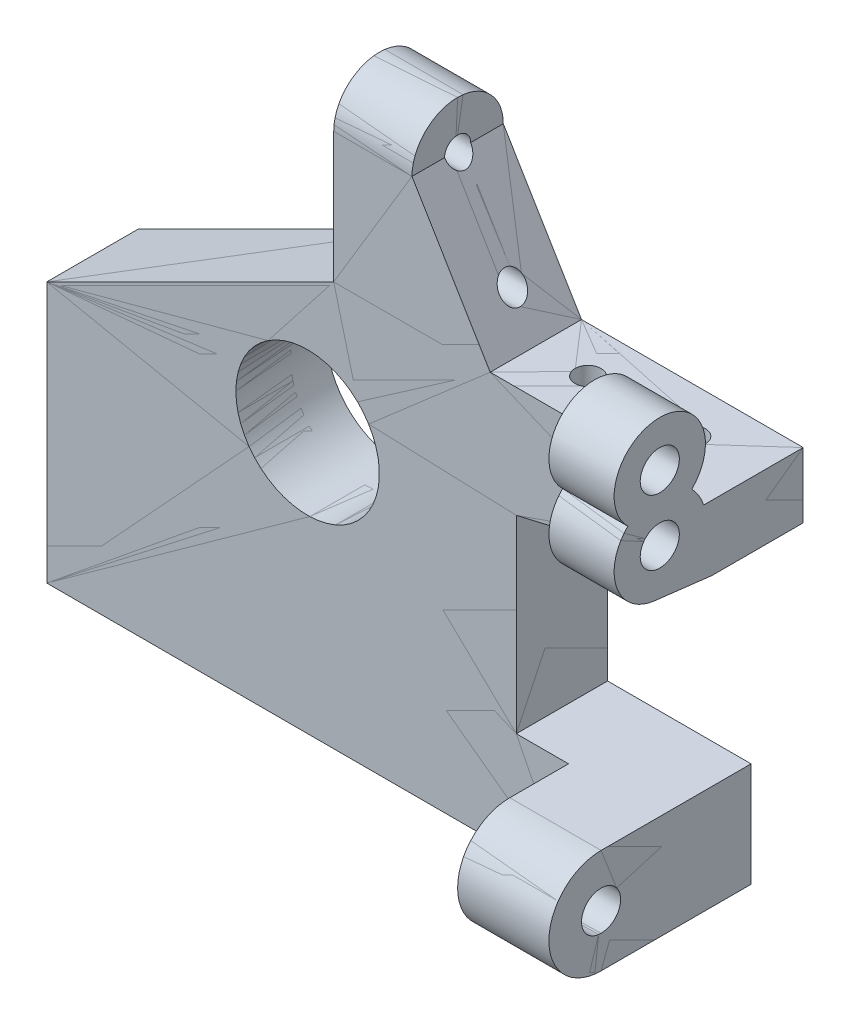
ISO-10303-21;
HEADER;
FILE_DESCRIPTION(('STEP AP214'),'2;1');
FILE_NAME('part.step','',(''),(''),'','','');
FILE_SCHEMA(('AUTOMOTIVE_DESIGN { 1 0 10303 214 1 1 1 1 }'));
ENDSEC;
DATA;
#1=APPLICATION_CONTEXT('core data for automotive mechanical design processes');
#2=APPLICATION_PROTOCOL_DEFINITION('international standard','automotive_design',2000,#1);
#3=PRODUCT_CONTEXT('',#1,'mechanical');
#4=PRODUCT('Part','Part','',(#3));
#5=PRODUCT_RELATED_PRODUCT_CATEGORY('part','',(#4));
#6=PRODUCT_DEFINITION_FORMATION('','',#4);
#7=PRODUCT_DEFINITION_CONTEXT('part definition',#1,'design');
#8=PRODUCT_DEFINITION('design','',#6,#7);
#9=PRODUCT_DEFINITION_SHAPE('','',#8);
#10=(LENGTH_UNIT() NAMED_UNIT(*) SI_UNIT(.MILLI.,.METRE.));
#11=(NAMED_UNIT(*) PLANE_ANGLE_UNIT() SI_UNIT($,.RADIAN.));
#12=(NAMED_UNIT(*) SI_UNIT($,.STERADIAN.) SOLID_ANGLE_UNIT());
#13=UNCERTAINTY_MEASURE_WITH_UNIT(LENGTH_MEASURE(1.E-05),#10,'distance_accuracy_value','');
#14=(GEOMETRIC_REPRESENTATION_CONTEXT(3) GLOBAL_UNCERTAINTY_ASSIGNED_CONTEXT((#13)) GLOBAL_UNIT_ASSIGNED_CONTEXT((#10,
#11,#12)) REPRESENTATION_CONTEXT('',''));
#15=CARTESIAN_POINT('',(0.,0.,0.));
#16=DIRECTION('',(0.,0.,1.));
#17=DIRECTION('',(1.,0.,0.));
#18=AXIS2_PLACEMENT_3D('',#15,#16,#17);
#19=CARTESIAN_POINT('',(-20.,-10.,0.));
#20=DIRECTION('',(0.,0.,-1.));
#21=DIRECTION('',(-1.,0.,0.));
#22=AXIS2_PLACEMENT_3D('',#19,#20,#21);
#23=CYLINDRICAL_SURFACE('',#22,5.5);
#24=CARTESIAN_POINT('',(-20.,-10.,0.));
#25=DIRECTION('',(0.,0.,-1.));
#26=DIRECTION('',(-1.,0.,0.));
#27=AXIS2_PLACEMENT_3D('',#24,#25,#26);
#28=CIRCLE('',#27,5.5);
#29=CARTESIAN_POINT('',(-25.5,-10.,0.));
#30=VERTEX_POINT('',#29);
#31=EDGE_CURVE('P0_E11',#30,#30,#28,.T.);
#32=ORIENTED_EDGE('',*,*,#31,.F.);
#33=EDGE_LOOP('',(#32));
#34=FACE_BOUND('',#33,.T.);
#35=CARTESIAN_POINT('',(-20.,-10.,-4.2));
#36=DIRECTION('',(0.,0.,-1.));
#37=DIRECTION('',(-1.,0.,0.));
#38=AXIS2_PLACEMENT_3D('',#35,#36,#37);
#39=CIRCLE('',#38,5.5);
#40=CARTESIAN_POINT('',(-25.5,-10.,-4.2));
#41=VERTEX_POINT('',#40);
#42=EDGE_CURVE('P0_E354',#41,#41,#39,.T.);
#43=ORIENTED_EDGE('',*,*,#42,.T.);
#44=EDGE_LOOP('',(#43));
#45=FACE_BOUND('',#44,.T.);
#46=ADVANCED_FACE('P0_F350',(#34,#45),#23,.F.);
#47=CARTESIAN_POINT('',(-35.,-25.,-4.5));
#48=DIRECTION('',(1.,0.,0.));
#49=DIRECTION('',(0.,0.,1.));
#50=AXIS2_PLACEMENT_3D('',#47,#48,#49);
#51=PLANE('',#50);
#52=CARTESIAN_POINT('',(-35.,-26.,-3.5));
#53=DIRECTION('',(-1.,0.,0.));
#54=DIRECTION('',(0.,0.,1.));
#55=AXIS2_PLACEMENT_3D('',#52,#53,#54);
#56=CIRCLE('',#55,1.);
#57=CARTESIAN_POINT('',(-35.,-26.,-2.5));
#58=VERTEX_POINT('',#57);
#59=EDGE_CURVE('P0_E718',#58,#58,#56,.F.);
#60=ORIENTED_EDGE('',*,*,#59,.F.);
#61=EDGE_LOOP('',(#60));
#62=FACE_BOUND('',#61,.T.);
#63=ADVANCED_FACE('P0_F902',(#62),#51,.F.);
#64=CARTESIAN_POINT('',(-32.,-25.,-4.5));
#65=DIRECTION('',(0.,1.,0.));
#66=DIRECTION('',(0.,0.,1.));
#67=AXIS2_PLACEMENT_3D('',#64,#65,#66);
#68=PLANE('',#67);
#69=CARTESIAN_POINT('',(-31.,-25.,-3.5));
#70=DIRECTION('',(0.,-1.,0.));
#71=DIRECTION('',(0.,0.,-1.));
#72=AXIS2_PLACEMENT_3D('',#69,#70,#71);
#73=CIRCLE('',#72,1.);
#74=CARTESIAN_POINT('',(-31.,-25.,-4.5));
#75=VERTEX_POINT('',#74);
#76=EDGE_CURVE('P0_E713',#75,#75,#73,.F.);
#77=ORIENTED_EDGE('',*,*,#76,.F.);
#78=EDGE_LOOP('',(#77));
#79=FACE_BOUND('',#78,.T.);
#80=ADVANCED_FACE('P0_F908',(#79),#68,.F.);
#81=CARTESIAN_POINT('',(-5.,-25.,-4.5));
#82=DIRECTION('',(0.,1.,0.));
#83=DIRECTION('',(0.,0.,1.));
#84=AXIS2_PLACEMENT_3D('',#81,#82,#83);
#85=PLANE('',#84);
#86=CARTESIAN_POINT('',(-4.,-25.,-3.5));
#87=DIRECTION('',(0.,-1.,0.));
#88=DIRECTION('',(0.,0.,-1.));
#89=AXIS2_PLACEMENT_3D('',#86,#87,#88);
#90=CIRCLE('',#89,1.);
#91=CARTESIAN_POINT('',(-4.,-25.,-4.5));
#92=VERTEX_POINT('',#91);
#93=EDGE_CURVE('P0_E710',#92,#92,#90,.F.);
#94=ORIENTED_EDGE('',*,*,#93,.F.);
#95=EDGE_LOOP('',(#94));
#96=FACE_BOUND('',#95,.T.);
#97=ADVANCED_FACE('P0_F1021',(#96),#85,.F.);
#98=CARTESIAN_POINT('',(7.,-4.,-4.5));
#99=DIRECTION('',(0.,-1.,0.));
#100=DIRECTION('',(0.,0.,1.));
#101=AXIS2_PLACEMENT_3D('',#98,#99,#100);
#102=PLANE('',#101);
#103=CARTESIAN_POINT('',(6.,-4.,-3.5));
#104=DIRECTION('',(0.,1.,0.));
#105=DIRECTION('',(0.,0.,1.));
#106=AXIS2_PLACEMENT_3D('',#103,#104,#105);
#107=CIRCLE('',#106,1.);
#108=CARTESIAN_POINT('',(6.,-4.,-2.5));
#109=VERTEX_POINT('',#108);
#110=EDGE_CURVE('P0_E682',#109,#109,#107,.F.);
#111=ORIENTED_EDGE('',*,*,#110,.F.);
#112=EDGE_LOOP('',(#111));
#113=FACE_BOUND('',#112,.T.);
#114=ADVANCED_FACE('P0_F1017',(#113),#102,.F.);
#115=CARTESIAN_POINT('',(-1.,-4.,-4.5));
#116=DIRECTION('',(0.,-1.,0.));
#117=DIRECTION('',(0.,0.,1.));
#118=AXIS2_PLACEMENT_3D('',#115,#116,#117);
#119=PLANE('',#118);
#120=CARTESIAN_POINT('',(-2.,-4.,-3.5));
#121=DIRECTION('',(0.,1.,0.));
#122=DIRECTION('',(0.,0.,1.));
#123=AXIS2_PLACEMENT_3D('',#120,#121,#122);
#124=CIRCLE('',#123,1.);
#125=CARTESIAN_POINT('',(-2.,-4.,-2.5));
#126=VERTEX_POINT('',#125);
#127=EDGE_CURVE('P0_E679',#126,#126,#124,.F.);
#128=ORIENTED_EDGE('',*,*,#127,.F.);
#129=EDGE_LOOP('',(#128));
#130=FACE_BOUND('',#129,.T.);
#131=ADVANCED_FACE('P0_F932',(#130),#119,.F.);
#132=CARTESIAN_POINT('',(-35.,-26.,-3.5));
#133=DIRECTION('',(-1.,0.,0.));
#134=DIRECTION('',(0.,0.,1.));
#135=AXIS2_PLACEMENT_3D('',#132,#133,#134);
#136=CYLINDRICAL_SURFACE('',#135,1.);
#137=ORIENTED_EDGE('',*,*,#59,.T.);
#138=EDGE_LOOP('',(#137));
#139=FACE_BOUND('',#138,.T.);
#140=CARTESIAN_POINT('',(-40.,-26.,-3.5));
#141=DIRECTION('',(-1.,0.,0.));
#142=DIRECTION('',(0.,0.,1.));
#143=AXIS2_PLACEMENT_3D('',#140,#141,#142);
#144=CIRCLE('',#143,1.);
#145=CARTESIAN_POINT('',(-40.,-26.,-2.5));
#146=VERTEX_POINT('',#145);
#147=EDGE_CURVE('P0_E673',#146,#146,#144,.F.);
#148=ORIENTED_EDGE('',*,*,#147,.F.);
#149=EDGE_LOOP('',(#148));
#150=FACE_BOUND('',#149,.T.);
#151=ADVANCED_FACE('P0_F928',(#139,#150),#136,.F.);
#152=CARTESIAN_POINT('',(-31.,-25.,-3.5));
#153=DIRECTION('',(0.,-1.,0.));
#154=DIRECTION('',(0.,0.,-1.));
#155=AXIS2_PLACEMENT_3D('',#152,#153,#154);
#156=CYLINDRICAL_SURFACE('',#155,1.);
#157=ORIENTED_EDGE('',*,*,#76,.T.);
#158=EDGE_LOOP('',(#157));
#159=FACE_BOUND('',#158,.T.);
#160=CARTESIAN_POINT('',(-31.,-30.,-3.5));
#161=DIRECTION('',(0.,-1.,0.));
#162=DIRECTION('',(0.,0.,-1.));
#163=AXIS2_PLACEMENT_3D('',#160,#161,#162);
#164=CIRCLE('',#163,1.);
#165=CARTESIAN_POINT('',(-31.,-30.,-4.5));
#166=VERTEX_POINT('',#165);
#167=EDGE_CURVE('P0_E576',#166,#166,#164,.F.);
#168=ORIENTED_EDGE('',*,*,#167,.F.);
#169=EDGE_LOOP('',(#168));
#170=FACE_BOUND('',#169,.T.);
#171=ADVANCED_FACE('P0_F931',(#159,#170),#156,.F.);
#172=CARTESIAN_POINT('',(-4.,-25.,-3.5));
#173=DIRECTION('',(0.,-1.,0.));
#174=DIRECTION('',(0.,0.,-1.));
#175=AXIS2_PLACEMENT_3D('',#172,#173,#174);
#176=CYLINDRICAL_SURFACE('',#175,1.);
#177=ORIENTED_EDGE('',*,*,#93,.T.);
#178=EDGE_LOOP('',(#177));
#179=FACE_BOUND('',#178,.T.);
#180=CARTESIAN_POINT('',(-4.,-30.,-3.5));
#181=DIRECTION('',(0.,-1.,0.));
#182=DIRECTION('',(0.,0.,-1.));
#183=AXIS2_PLACEMENT_3D('',#180,#181,#182);
#184=CIRCLE('',#183,1.);
#185=CARTESIAN_POINT('',(-4.,-30.,-4.5));
#186=VERTEX_POINT('',#185);
#187=EDGE_CURVE('P0_E664',#186,#186,#184,.F.);
#188=ORIENTED_EDGE('',*,*,#187,.F.);
#189=EDGE_LOOP('',(#188));
#190=FACE_BOUND('',#189,.T.);
#191=ADVANCED_FACE('P0_F935',(#179,#190),#176,.F.);
#192=CARTESIAN_POINT('',(7.,-26.,4.5));
#193=DIRECTION('',(-1.,0.,0.));
#194=DIRECTION('',(0.,-1.,0.));
#195=AXIS2_PLACEMENT_3D('',#192,#193,#194);
#196=CYLINDRICAL_SURFACE('',#195,1.5);
#197=CARTESIAN_POINT('',(0.,-26.,4.5));
#198=DIRECTION('',(-1.,0.,0.));
#199=DIRECTION('',(0.,-1.,0.));
#200=AXIS2_PLACEMENT_3D('',#197,#198,#199);
#201=CIRCLE('',#200,1.5);
#202=CARTESIAN_POINT('',(0.,-27.5,4.5));
#203=VERTEX_POINT('',#202);
#204=EDGE_CURVE('P0_E656',#203,#203,#201,.F.);
#205=ORIENTED_EDGE('',*,*,#204,.F.);
#206=EDGE_LOOP('',(#205));
#207=FACE_BOUND('',#206,.T.);
#208=CARTESIAN_POINT('',(7.,-26.,4.5));
#209=DIRECTION('',(-1.,0.,0.));
#210=DIRECTION('',(0.,-1.,0.));
#211=AXIS2_PLACEMENT_3D('',#208,#209,#210);
#212=CIRCLE('',#211,1.5);
#213=CARTESIAN_POINT('',(7.,-27.5,4.5));
#214=VERTEX_POINT('',#213);
#215=EDGE_CURVE('P0_E543',#214,#214,#212,.T.);
#216=ORIENTED_EDGE('',*,*,#215,.F.);
#217=EDGE_LOOP('',(#216));
#218=FACE_BOUND('',#217,.T.);
#219=ADVANCED_FACE('P0_F939',(#207,#218),#196,.F.);
#220=CARTESIAN_POINT('',(0.,-26.,4.5));
#221=DIRECTION('',(1.,0.,0.));
#222=DIRECTION('',(0.,0.,-1.));
#223=AXIS2_PLACEMENT_3D('',#220,#221,#222);
#224=CYLINDRICAL_SURFACE('',#223,4.00000000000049);
#225=DIRECTION('',(1.,0.,0.));
#226=VECTOR('',#225,1.);
#227=CARTESIAN_POINT('',(1.25000000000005,-22.,4.4999999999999));
#228=LINE('',#227,#226);
#229=CARTESIAN_POINT('',(0.,-22.,4.49999999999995));
#230=VERTEX_POINT('',#229);
#231=CARTESIAN_POINT('',(7.,-22.,4.49999999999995));
#232=VERTEX_POINT('',#231);
#233=EDGE_CURVE('P0_E568',#230,#232,#228,.T.);
#234=ORIENTED_EDGE('',*,*,#233,.F.);
#235=CARTESIAN_POINT('',(0.,-26.,4.5));
#236=DIRECTION('',(1.,0.,0.));
#237=DIRECTION('',(0.,0.,-1.));
#238=AXIS2_PLACEMENT_3D('',#235,#236,#237);
#239=CIRCLE('',#238,4.00000000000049);
#240=CARTESIAN_POINT('',(0.,-30.0000000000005,4.49999999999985));
#241=VERTEX_POINT('',#240);
#242=EDGE_CURVE('P0_E659',#241,#230,#239,.F.);
#243=ORIENTED_EDGE('',*,*,#242,.F.);
#244=DIRECTION('',(-1.,0.,0.));
#245=VECTOR('',#244,1.);
#246=CARTESIAN_POINT('',(-16.5,-30.,4.4999999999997));
#247=LINE('',#246,#245);
#248=CARTESIAN_POINT('',(7.,-30.,4.49999999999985));
#249=VERTEX_POINT('',#248);
#250=EDGE_CURVE('P0_E574',#249,#241,#247,.T.);
#251=ORIENTED_EDGE('',*,*,#250,.F.);
#252=CARTESIAN_POINT('',(7.,-26.,4.5));
#253=DIRECTION('',(1.,0.,0.));
#254=DIRECTION('',(0.,0.,-1.));
#255=AXIS2_PLACEMENT_3D('',#252,#253,#254);
#256=CIRCLE('',#255,4.00000000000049);
#257=EDGE_CURVE('P0_E451',#232,#249,#256,.T.);
#258=ORIENTED_EDGE('',*,*,#257,.F.);
#259=EDGE_LOOP('',(#234,#243,#251,#258));
#260=FACE_BOUND('',#259,.T.);
#261=ADVANCED_FACE('P0_F867',(#260),#224,.T.);
#262=CARTESIAN_POINT('',(7.,-30.000000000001,8.5000000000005));
#263=DIRECTION('',(1.,0.,0.));
#264=DIRECTION('',(0.,0.,-1.));
#265=AXIS2_PLACEMENT_3D('',#262,#263,#264);
#266=PLANE('',#265);
#267=ORIENTED_EDGE('',*,*,#215,.T.);
#268=EDGE_LOOP('',(#267));
#269=FACE_BOUND('',#268,.T.);
#270=DIRECTION('',(0.,0.,-1.));
#271=VECTOR('',#270,1.);
#272=CARTESIAN_POINT('',(7.,-22.,-1.25000000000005));
#273=LINE('',#272,#271);
#274=CARTESIAN_POINT('',(6.99999999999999,-22.,-7.));
#275=VERTEX_POINT('',#274);
#276=EDGE_CURVE('P0_E560',#232,#275,#273,.T.);
#277=ORIENTED_EDGE('',*,*,#276,.F.);
#278=ORIENTED_EDGE('',*,*,#257,.T.);
#279=DIRECTION('',(0.,0.,1.));
#280=VECTOR('',#279,1.);
#281=CARTESIAN_POINT('',(7.,-30.,-19.0000000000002));
#282=LINE('',#281,#280);
#283=CARTESIAN_POINT('',(6.99999999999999,-30.,-6.99999999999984));
#284=VERTEX_POINT('',#283);
#285=EDGE_CURVE('P0_E577',#284,#249,#282,.T.);
#286=ORIENTED_EDGE('',*,*,#285,.F.);
#287=DIRECTION('',(0.,-1.,0.));
#288=VECTOR('',#287,1.);
#289=CARTESIAN_POINT('',(6.99999999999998,-4.5,-7.));
#290=LINE('',#289,#288);
#291=EDGE_CURVE('P0_E459',#275,#284,#290,.T.);
#292=ORIENTED_EDGE('',*,*,#291,.F.);
#293=EDGE_LOOP('',(#277,#278,#286,#292));
#294=FACE_BOUND('',#293,.T.);
#295=ADVANCED_FACE('P0_F865',(#269,#294),#266,.T.);
#296=CARTESIAN_POINT('',(6.,0.,4.));
#297=DIRECTION('',(1.,0.,0.));
#298=DIRECTION('',(0.,0.,-1.));
#299=AXIS2_PLACEMENT_3D('',#296,#297,#298);
#300=CYLINDRICAL_SURFACE('',#299,3.49999999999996);
#301=DIRECTION('',(-1.,0.,0.));
#302=VECTOR('',#301,1.);
#303=CARTESIAN_POINT('',(8.5,2.50000000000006,6.44948974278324));
#304=LINE('',#303,#302);
#305=CARTESIAN_POINT('',(11.,2.50000000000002,6.4494897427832));
#306=VERTEX_POINT('',#305);
#307=CARTESIAN_POINT('',(6.,2.50000000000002,6.4494897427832));
#308=VERTEX_POINT('',#307);
#309=EDGE_CURVE('P0_E541',#306,#308,#304,.T.);
#310=ORIENTED_EDGE('',*,*,#309,.T.);
#311=CARTESIAN_POINT('',(6.,0.,4.));
#312=DIRECTION('',(1.,0.,0.));
#313=DIRECTION('',(0.,0.,-1.));
#314=AXIS2_PLACEMENT_3D('',#311,#312,#313);
#315=CIRCLE('',#314,3.49999999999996);
#316=CARTESIAN_POINT('',(6.,-3.47554252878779,4.41304252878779));
#317=VERTEX_POINT('',#316);
#318=EDGE_CURVE('P0_E651',#317,#308,#315,.F.);
#319=ORIENTED_EDGE('',*,*,#318,.F.);
#320=DIRECTION('',(-1.,0.,0.));
#321=VECTOR('',#320,1.);
#322=CARTESIAN_POINT('',(8.5,-3.4755425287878,4.4130425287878));
#323=LINE('',#322,#321);
#324=CARTESIAN_POINT('',(11.,-3.4755425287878,4.41304252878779));
#325=VERTEX_POINT('',#324);
#326=EDGE_CURVE('P0_E544',#325,#317,#323,.T.);
#327=ORIENTED_EDGE('',*,*,#326,.F.);
#328=CARTESIAN_POINT('',(11.,0.,4.));
#329=DIRECTION('',(1.,0.,0.));
#330=DIRECTION('',(0.,0.,-1.));
#331=AXIS2_PLACEMENT_3D('',#328,#329,#330);
#332=CIRCLE('',#331,3.49999999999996);
#333=EDGE_CURVE('P0_E697',#306,#325,#332,.T.);
#334=ORIENTED_EDGE('',*,*,#333,.F.);
#335=EDGE_LOOP('',(#310,#319,#327,#334));
#336=FACE_BOUND('',#335,.T.);
#337=ADVANCED_FACE('P0_F854',(#336),#300,.T.);
#338=CARTESIAN_POINT('',(6.,5.,4.));
#339=DIRECTION('',(1.,0.,0.));
#340=DIRECTION('',(0.,0.,-1.));
#341=AXIS2_PLACEMENT_3D('',#338,#339,#340);
#342=CYLINDRICAL_SURFACE('',#341,3.5);
#343=DIRECTION('',(-1.,0.,0.));
#344=VECTOR('',#343,1.);
#345=CARTESIAN_POINT('',(8.5,2.49999999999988,1.55051025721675));
#346=LINE('',#345,#344);
#347=CARTESIAN_POINT('',(11.,2.49999999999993,1.5505102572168));
#348=VERTEX_POINT('',#347);
#349=CARTESIAN_POINT('',(6.,2.49999999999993,1.5505102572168));
#350=VERTEX_POINT('',#349);
#351=EDGE_CURVE('P0_E538',#348,#350,#346,.T.);
#352=ORIENTED_EDGE('',*,*,#351,.T.);
#353=CARTESIAN_POINT('',(6.,5.,4.));
#354=DIRECTION('',(1.,0.,0.));
#355=DIRECTION('',(0.,0.,-1.));
#356=AXIS2_PLACEMENT_3D('',#353,#354,#355);
#357=CIRCLE('',#356,3.5);
#358=EDGE_CURVE('P0_E648',#308,#350,#357,.F.);
#359=ORIENTED_EDGE('',*,*,#358,.F.);
#360=ORIENTED_EDGE('',*,*,#309,.F.);
#361=CARTESIAN_POINT('',(11.,5.,4.));
#362=DIRECTION('',(1.,0.,0.));
#363=DIRECTION('',(0.,0.,-1.));
#364=AXIS2_PLACEMENT_3D('',#361,#362,#363);
#365=CIRCLE('',#364,3.5);
#366=EDGE_CURVE('P0_E701',#348,#306,#365,.T.);
#367=ORIENTED_EDGE('',*,*,#366,.F.);
#368=EDGE_LOOP('',(#352,#359,#360,#367));
#369=FACE_BOUND('',#368,.T.);
#370=ADVANCED_FACE('P0_F852',(#369),#342,.T.);
#371=CARTESIAN_POINT('',(11.,5.,4.));
#372=DIRECTION('',(-1.,0.,0.));
#373=DIRECTION('',(0.,0.,1.));
#374=AXIS2_PLACEMENT_3D('',#371,#372,#373);
#375=CYLINDRICAL_SURFACE('',#374,1.5);
#376=CARTESIAN_POINT('',(6.,5.,4.));
#377=DIRECTION('',(-1.,0.,0.));
#378=DIRECTION('',(0.,0.,1.));
#379=AXIS2_PLACEMENT_3D('',#376,#377,#378);
#380=CIRCLE('',#379,1.5);
#381=CARTESIAN_POINT('',(6.,5.,5.5));
#382=VERTEX_POINT('',#381);
#383=EDGE_CURVE('P0_E639',#382,#382,#380,.F.);
#384=ORIENTED_EDGE('',*,*,#383,.F.);
#385=EDGE_LOOP('',(#384));
#386=FACE_BOUND('',#385,.T.);
#387=CARTESIAN_POINT('',(11.,5.,4.));
#388=DIRECTION('',(-1.,0.,0.));
#389=DIRECTION('',(0.,0.,1.));
#390=AXIS2_PLACEMENT_3D('',#387,#388,#389);
#391=CIRCLE('',#390,1.5);
#392=CARTESIAN_POINT('',(11.,5.,5.5));
#393=VERTEX_POINT('',#392);
#394=EDGE_CURVE('P0_E692',#393,#393,#391,.T.);
#395=ORIENTED_EDGE('',*,*,#394,.F.);
#396=EDGE_LOOP('',(#395));
#397=FACE_BOUND('',#396,.T.);
#398=ADVANCED_FACE('P0_F950',(#386,#397),#375,.F.);
#399=CARTESIAN_POINT('',(11.,0.,4.));
#400=DIRECTION('',(-1.,0.,0.));
#401=DIRECTION('',(0.,0.,1.));
#402=AXIS2_PLACEMENT_3D('',#399,#400,#401);
#403=CYLINDRICAL_SURFACE('',#402,1.5);
#404=CARTESIAN_POINT('',(6.,0.,4.));
#405=DIRECTION('',(-1.,0.,0.));
#406=DIRECTION('',(0.,0.,1.));
#407=AXIS2_PLACEMENT_3D('',#404,#405,#406);
#408=CIRCLE('',#407,1.5);
#409=CARTESIAN_POINT('',(6.,0.,5.5));
#410=VERTEX_POINT('',#409);
#411=EDGE_CURVE('P0_E636',#410,#410,#408,.F.);
#412=ORIENTED_EDGE('',*,*,#411,.F.);
#413=EDGE_LOOP('',(#412));
#414=FACE_BOUND('',#413,.T.);
#415=CARTESIAN_POINT('',(11.,0.,4.));
#416=DIRECTION('',(-1.,0.,0.));
#417=DIRECTION('',(0.,0.,1.));
#418=AXIS2_PLACEMENT_3D('',#415,#416,#417);
#419=CIRCLE('',#418,1.5);
#420=CARTESIAN_POINT('',(11.,0.,5.5));
#421=VERTEX_POINT('',#420);
#422=EDGE_CURVE('P0_E687',#421,#421,#419,.T.);
#423=ORIENTED_EDGE('',*,*,#422,.F.);
#424=EDGE_LOOP('',(#423));
#425=FACE_BOUND('',#424,.T.);
#426=ADVANCED_FACE('P0_F953',(#414,#425),#403,.F.);
#427=CARTESIAN_POINT('',(6.,0.,4.));
#428=DIRECTION('',(1.,0.,0.));
#429=DIRECTION('',(0.,0.,-1.));
#430=AXIS2_PLACEMENT_3D('',#427,#428,#429);
#431=CYLINDRICAL_SURFACE('',#430,3.49999999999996);
#432=DIRECTION('',(1.,0.,0.));
#433=VECTOR('',#432,1.);
#434=CARTESIAN_POINT('',(2.5,1.,0.6458980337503));
#435=LINE('',#434,#433);
#436=CARTESIAN_POINT('',(6.00000000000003,1.,0.645898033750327));
#437=VERTEX_POINT('',#436);
#438=CARTESIAN_POINT('',(11.,1.,0.645898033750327));
#439=VERTEX_POINT('',#438);
#440=EDGE_CURVE('P0_E529',#437,#439,#435,.T.);
#441=ORIENTED_EDGE('',*,*,#440,.F.);
#442=CARTESIAN_POINT('',(6.,0.,4.));
#443=DIRECTION('',(1.,0.,0.));
#444=DIRECTION('',(0.,0.,-1.));
#445=AXIS2_PLACEMENT_3D('',#442,#443,#444);
#446=CIRCLE('',#445,3.49999999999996);
#447=EDGE_CURVE('P0_E644',#350,#437,#446,.F.);
#448=ORIENTED_EDGE('',*,*,#447,.F.);
#449=ORIENTED_EDGE('',*,*,#351,.F.);
#450=CARTESIAN_POINT('',(11.,0.,4.));
#451=DIRECTION('',(1.,0.,0.));
#452=DIRECTION('',(0.,0.,-1.));
#453=AXIS2_PLACEMENT_3D('',#450,#451,#452);
#454=CIRCLE('',#453,3.49999999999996);
#455=EDGE_CURVE('P0_E540',#439,#348,#454,.T.);
#456=ORIENTED_EDGE('',*,*,#455,.F.);
#457=EDGE_LOOP('',(#441,#448,#449,#456));
#458=FACE_BOUND('',#457,.T.);
#459=ADVANCED_FACE('P0_F847',(#458),#431,.T.);
#460=CARTESIAN_POINT('',(11.,-4.,8.96655584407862));
#461=DIRECTION('',(1.,0.,0.));
#462=DIRECTION('',(0.,0.,-1.));
#463=AXIS2_PLACEMENT_3D('',#460,#461,#462);
#464=PLANE('',#463);
#465=ORIENTED_EDGE('',*,*,#422,.T.);
#466=EDGE_LOOP('',(#465));
#467=FACE_BOUND('',#466,.T.);
#468=ORIENTED_EDGE('',*,*,#394,.T.);
#469=EDGE_LOOP('',(#468));
#470=FACE_BOUND('',#469,.T.);
#471=ORIENTED_EDGE('',*,*,#333,.T.);
#472=DIRECTION('',(0.,0.11801215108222,0.993012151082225));
#473=VECTOR('',#472,1.);
#474=CARTESIAN_POINT('',(11.,-3.77057290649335,1.93051215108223));
#475=LINE('',#474,#473);
#476=CARTESIAN_POINT('',(11.,-3.99999999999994,-1.63118216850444E-13));
#477=VERTEX_POINT('',#476);
#478=EDGE_CURVE('P0_E548',#477,#325,#475,.T.);
#479=ORIENTED_EDGE('',*,*,#478,.F.);
#480=DIRECTION('',(0.,0.,1.));
#481=VECTOR('',#480,1.);
#482=CARTESIAN_POINT('',(11.,-4.,-7.7014609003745));
#483=LINE('',#482,#481);
#484=CARTESIAN_POINT('',(11.,-3.99999999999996,-6.99999999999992));
#485=VERTEX_POINT('',#484);
#486=EDGE_CURVE('P0_E515',#485,#477,#483,.T.);
#487=ORIENTED_EDGE('',*,*,#486,.F.);
#488=DIRECTION('',(0.,-1.,0.));
#489=VECTOR('',#488,1.);
#490=CARTESIAN_POINT('',(11.,-4.5,-7.));
#491=LINE('',#490,#489);
#492=CARTESIAN_POINT('',(11.,1.,-7.00000000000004));
#493=VERTEX_POINT('',#492);
#494=EDGE_CURVE('P0_E472',#493,#485,#491,.T.);
#495=ORIENTED_EDGE('',*,*,#494,.F.);
#496=DIRECTION('',(0.,0.,-1.));
#497=VECTOR('',#496,1.);
#498=CARTESIAN_POINT('',(11.,1.,-7.85410196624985));
#499=LINE('',#498,#497);
#500=EDGE_CURVE('P0_E512',#439,#493,#499,.T.);
#501=ORIENTED_EDGE('',*,*,#500,.F.);
#502=ORIENTED_EDGE('',*,*,#455,.T.);
#503=ORIENTED_EDGE('',*,*,#366,.T.);
#504=EDGE_LOOP('',(#471,#479,#487,#495,#501,#502,#503));
#505=FACE_BOUND('',#504,.T.);
#506=ADVANCED_FACE('P0_F510',(#467,#470,#505),#464,.T.);
#507=CARTESIAN_POINT('',(6.,-4.,-3.5));
#508=DIRECTION('',(0.,1.,0.));
#509=DIRECTION('',(0.,0.,1.));
#510=AXIS2_PLACEMENT_3D('',#507,#508,#509);
#511=CYLINDRICAL_SURFACE('',#510,1.);
#512=ORIENTED_EDGE('',*,*,#110,.T.);
#513=EDGE_LOOP('',(#512));
#514=FACE_BOUND('',#513,.T.);
#515=CARTESIAN_POINT('',(6.,1.,-3.5));
#516=DIRECTION('',(0.,1.,0.));
#517=DIRECTION('',(0.,0.,1.));
#518=AXIS2_PLACEMENT_3D('',#515,#516,#517);
#519=CIRCLE('',#518,1.);
#520=CARTESIAN_POINT('',(6.,1.,-2.5));
#521=VERTEX_POINT('',#520);
#522=EDGE_CURVE('P0_E524',#521,#521,#519,.F.);
#523=ORIENTED_EDGE('',*,*,#522,.F.);
#524=EDGE_LOOP('',(#523));
#525=FACE_BOUND('',#524,.T.);
#526=ADVANCED_FACE('P0_F960',(#514,#525),#511,.F.);
#527=CARTESIAN_POINT('',(-2.,-4.,-3.5));
#528=DIRECTION('',(0.,1.,0.));
#529=DIRECTION('',(0.,0.,1.));
#530=AXIS2_PLACEMENT_3D('',#527,#528,#529);
#531=CYLINDRICAL_SURFACE('',#530,1.);
#532=ORIENTED_EDGE('',*,*,#127,.T.);
#533=EDGE_LOOP('',(#532));
#534=FACE_BOUND('',#533,.T.);
#535=CARTESIAN_POINT('',(-2.,1.,-3.5));
#536=DIRECTION('',(0.,1.,0.));
#537=DIRECTION('',(0.,0.,1.));
#538=AXIS2_PLACEMENT_3D('',#535,#536,#537);
#539=CIRCLE('',#538,1.);
#540=CARTESIAN_POINT('',(-2.,1.,-2.5));
#541=VERTEX_POINT('',#540);
#542=EDGE_CURVE('P0_E626',#541,#541,#539,.F.);
#543=ORIENTED_EDGE('',*,*,#542,.F.);
#544=EDGE_LOOP('',(#543));
#545=FACE_BOUND('',#544,.T.);
#546=ADVANCED_FACE('P0_F963',(#534,#545),#531,.F.);
#547=CARTESIAN_POINT('',(-12.,14.5,-7.));
#548=DIRECTION('',(1.,0.,0.));
#549=DIRECTION('',(0.,0.,1.));
#550=AXIS2_PLACEMENT_3D('',#547,#548,#549);
#551=PLANE('',#550);
#552=CARTESIAN_POINT('',(-12.,11.,-3.5));
#553=DIRECTION('',(-1.,0.,0.));
#554=DIRECTION('',(0.,0.,1.));
#555=AXIS2_PLACEMENT_3D('',#552,#553,#554);
#556=CIRCLE('',#555,1.);
#557=CARTESIAN_POINT('',(-12.,11.,-4.5));
#558=VERTEX_POINT('',#557);
#559=CARTESIAN_POINT('',(-12.,11.,-2.5));
#560=VERTEX_POINT('',#559);
#561=EDGE_CURVE('P0_E517',#558,#560,#556,.F.);
#562=ORIENTED_EDGE('',*,*,#561,.F.);
#563=DIRECTION('',(0.,0.,1.));
#564=VECTOR('',#563,1.);
#565=CARTESIAN_POINT('',(-12.,11.,-5.8309518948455));
#566=LINE('',#565,#564);
#567=CARTESIAN_POINT('',(-12.,11.,-7.00000000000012));
#568=VERTEX_POINT('',#567);
#569=EDGE_CURVE('P0_E625',#568,#558,#566,.T.);
#570=ORIENTED_EDGE('',*,*,#569,.F.);
#571=CARTESIAN_POINT('',(-12.,11.,-3.5));
#572=DIRECTION('',(-1.,0.,0.));
#573=DIRECTION('',(0.,0.,1.));
#574=AXIS2_PLACEMENT_3D('',#571,#572,#573);
#575=CIRCLE('',#574,3.5);
#576=CARTESIAN_POINT('',(-11.9999999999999,11.,0.));
#577=VERTEX_POINT('',#576);
#578=EDGE_CURVE('P0_E615',#568,#577,#575,.F.);
#579=ORIENTED_EDGE('',*,*,#578,.T.);
#580=DIRECTION('',(0.,0.,1.));
#581=VECTOR('',#580,1.);
#582=CARTESIAN_POINT('',(-12.,11.,-5.8309518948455));
#583=LINE('',#582,#581);
#584=EDGE_CURVE('P0_E621',#560,#577,#583,.T.);
#585=ORIENTED_EDGE('',*,*,#584,.F.);
#586=EDGE_LOOP('',(#562,#570,#579,#585));
#587=FACE_BOUND('',#586,.T.);
#588=ADVANCED_FACE('P0_F883',(#587),#551,.T.);
#589=CARTESIAN_POINT('',(-11.4,11.,-3.5));
#590=DIRECTION('',(-1.,0.,0.));
#591=DIRECTION('',(0.,0.,1.));
#592=AXIS2_PLACEMENT_3D('',#589,#590,#591);
#593=CYLINDRICAL_SURFACE('',#592,1.);
#594=CARTESIAN_POINT('',(-12.,11.,-3.5));
#595=DIRECTION('',(0.857492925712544,0.514495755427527,0.));
#596=DIRECTION('',(-0.514495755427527,0.857492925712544,0.));
#597=AXIS2_PLACEMENT_3D('',#594,#595,#596);
#598=ELLIPSE('',#597,1.16619037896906,1.);
#599=EDGE_CURVE('P0_E622',#558,#560,#598,.F.);
#600=ORIENTED_EDGE('',*,*,#599,.F.);
#601=ORIENTED_EDGE('',*,*,#561,.T.);
#602=EDGE_LOOP('',(#600,#601));
#603=FACE_BOUND('',#602,.T.);
#604=CARTESIAN_POINT('',(-18.,11.,-3.5));
#605=DIRECTION('',(-1.,0.,0.));
#606=DIRECTION('',(0.,0.,1.));
#607=AXIS2_PLACEMENT_3D('',#604,#605,#606);
#608=CIRCLE('',#607,1.);
#609=CARTESIAN_POINT('',(-18.,11.,-2.5));
#610=VERTEX_POINT('',#609);
#611=EDGE_CURVE('P0_E606',#610,#610,#608,.F.);
#612=ORIENTED_EDGE('',*,*,#611,.F.);
#613=EDGE_LOOP('',(#612));
#614=FACE_BOUND('',#613,.T.);
#615=ADVANCED_FACE('P0_F885',(#603,#614),#593,.F.);
#616=CARTESIAN_POINT('',(-7.2,4.,-3.5));
#617=DIRECTION('',(-1.,0.,0.));
#618=DIRECTION('',(0.,0.,1.));
#619=AXIS2_PLACEMENT_3D('',#616,#617,#618);
#620=CYLINDRICAL_SURFACE('',#619,1.);
#621=CARTESIAN_POINT('',(-7.8,4.,-3.5));
#622=DIRECTION('',(0.857492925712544,0.514495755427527,0.));
#623=DIRECTION('',(-0.514495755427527,0.857492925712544,0.));
#624=AXIS2_PLACEMENT_3D('',#621,#622,#623);
#625=ELLIPSE('',#624,1.16619037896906,1.);
#626=CARTESIAN_POINT('',(-8.4,5.,-3.5));
#627=VERTEX_POINT('',#626);
#628=EDGE_CURVE('P0_E618',#627,#627,#625,.F.);
#629=ORIENTED_EDGE('',*,*,#628,.F.);
#630=EDGE_LOOP('',(#629));
#631=FACE_BOUND('',#630,.T.);
#632=CARTESIAN_POINT('',(-18.,4.,-3.5));
#633=DIRECTION('',(-1.,0.,0.));
#634=DIRECTION('',(0.,0.,1.));
#635=AXIS2_PLACEMENT_3D('',#632,#633,#634);
#636=CIRCLE('',#635,1.);
#637=CARTESIAN_POINT('',(-18.,4.,-2.5));
#638=VERTEX_POINT('',#637);
#639=EDGE_CURVE('P0_E603',#638,#638,#636,.F.);
#640=ORIENTED_EDGE('',*,*,#639,.F.);
#641=EDGE_LOOP('',(#640));
#642=FACE_BOUND('',#641,.T.);
#643=ADVANCED_FACE('P0_F888',(#631,#642),#620,.F.);
#644=CARTESIAN_POINT('',(11.,-30.,-7.));
#645=DIRECTION('',(0.,0.,-1.));
#646=DIRECTION('',(-1.,0.,0.));
#647=AXIS2_PLACEMENT_3D('',#644,#645,#646);
#648=PLANE('',#647);
#649=CARTESIAN_POINT('',(-20.,-10.,-7.));
#650=DIRECTION('',(0.,0.,-1.));
#651=DIRECTION('',(-1.,0.,0.));
#652=AXIS2_PLACEMENT_3D('',#649,#650,#651);
#653=CIRCLE('',#652,7.);
#654=CARTESIAN_POINT('',(-27.,-10.,-7.));
#655=VERTEX_POINT('',#654);
#656=EDGE_CURVE('P0_E730',#655,#655,#653,.T.);
#657=ORIENTED_EDGE('',*,*,#656,.F.);
#658=EDGE_LOOP('',(#657));
#659=FACE_BOUND('',#658,.T.);
#660=DIRECTION('',(1.,0.,0.));
#661=VECTOR('',#660,1.);
#662=CARTESIAN_POINT('',(-16.5,-30.,-6.99999999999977));
#663=LINE('',#662,#661);
#664=CARTESIAN_POINT('',(-40.,-30.,-6.99999999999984));
#665=VERTEX_POINT('',#664);
#666=EDGE_CURVE('P0_E580',#665,#284,#663,.T.);
#667=ORIENTED_EDGE('',*,*,#666,.F.);
#668=DIRECTION('',(0.,-1.,0.));
#669=VECTOR('',#668,1.);
#670=CARTESIAN_POINT('',(-40.,-20.,-7.));
#671=LINE('',#670,#669);
#672=CARTESIAN_POINT('',(-40.,-10.,-7.00000000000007));
#673=VERTEX_POINT('',#672);
#674=EDGE_CURVE('P0_E497',#673,#665,#671,.T.);
#675=ORIENTED_EDGE('',*,*,#674,.F.);
#676=DIRECTION('',(-0.894427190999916,-0.447213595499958,0.));
#677=VECTOR('',#676,1.);
#678=CARTESIAN_POINT('',(-29.,-4.5,-7.0000000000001));
#679=LINE('',#678,#677);
#680=CARTESIAN_POINT('',(-18.,1.,-7.00000000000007));
#681=VERTEX_POINT('',#680);
#682=EDGE_CURVE('P0_E749',#681,#673,#679,.T.);
#683=ORIENTED_EDGE('',*,*,#682,.F.);
#684=DIRECTION('',(0.,-1.,0.));
#685=VECTOR('',#684,1.);
#686=CARTESIAN_POINT('',(-18.,7.75,-7.00000000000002));
#687=LINE('',#686,#685);
#688=CARTESIAN_POINT('',(-18.,11.,-7.00000000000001));
#689=VERTEX_POINT('',#688);
#690=EDGE_CURVE('P0_E502',#689,#681,#687,.T.);
#691=ORIENTED_EDGE('',*,*,#690,.F.);
#692=DIRECTION('',(1.,0.,0.));
#693=VECTOR('',#692,1.);
#694=CARTESIAN_POINT('',(-15.,11.,-7.));
#695=LINE('',#694,#693);
#696=EDGE_CURVE('P0_E617',#689,#568,#695,.T.);
#697=ORIENTED_EDGE('',*,*,#696,.T.);
#698=DIRECTION('',(-0.514495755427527,0.857492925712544,0.));
#699=VECTOR('',#698,1.);
#700=CARTESIAN_POINT('',(-9.,6.,-7.00000000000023));
#701=LINE('',#700,#699);
#702=CARTESIAN_POINT('',(-6.,0.999999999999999,-7.00000000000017));
#703=VERTEX_POINT('',#702);
#704=EDGE_CURVE('P0_E522',#703,#568,#701,.T.);
#705=ORIENTED_EDGE('',*,*,#704,.F.);
#706=DIRECTION('',(-1.,0.,0.));
#707=VECTOR('',#706,1.);
#708=CARTESIAN_POINT('',(2.5,1.,-7.00000000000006));
#709=LINE('',#708,#707);
#710=EDGE_CURVE('P0_E506',#493,#703,#709,.T.);
#711=ORIENTED_EDGE('',*,*,#710,.F.);
#712=ORIENTED_EDGE('',*,*,#494,.T.);
#713=DIRECTION('',(0.973841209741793,0.227229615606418,0.));
#714=VECTOR('',#713,1.);
#715=CARTESIAN_POINT('',(3.5,-5.75,-6.99999999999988));
#716=LINE('',#715,#714);
#717=CARTESIAN_POINT('',(-4.,-7.5,-6.99999999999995));
#718=VERTEX_POINT('',#717);
#719=EDGE_CURVE('P0_E549',#718,#485,#716,.T.);
#720=ORIENTED_EDGE('',*,*,#719,.F.);
#721=DIRECTION('',(0.,1.,0.));
#722=VECTOR('',#721,1.);
#723=CARTESIAN_POINT('',(-4.,-14.75,-7.00000000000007));
#724=LINE('',#723,#722);
#725=CARTESIAN_POINT('',(-4.00000000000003,-22.,-7.00000000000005));
#726=VERTEX_POINT('',#725);
#727=EDGE_CURVE('P0_E479',#726,#718,#724,.T.);
#728=ORIENTED_EDGE('',*,*,#727,.F.);
#729=DIRECTION('',(-1.,0.,0.));
#730=VECTOR('',#729,1.);
#731=CARTESIAN_POINT('',(1.25000000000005,-22.,-7.));
#732=LINE('',#731,#730);
#733=EDGE_CURVE('P0_E558',#275,#726,#732,.T.);
#734=ORIENTED_EDGE('',*,*,#733,.F.);
#735=ORIENTED_EDGE('',*,*,#291,.T.);
#736=EDGE_LOOP('',(#667,#675,#683,#691,#697,#705,#711,#712,#720,#728,#734,#735));
#737=FACE_BOUND('',#736,.T.);
#738=ADVANCED_FACE('P0_F519',(#659,#737),#648,.T.);
#739=CARTESIAN_POINT('',(-40.,-10.,0.));
#740=DIRECTION('',(-1.,0.,0.));
#741=DIRECTION('',(0.,0.,-1.));
#742=AXIS2_PLACEMENT_3D('',#739,#740,#741);
#743=PLANE('',#742);
#744=ORIENTED_EDGE('',*,*,#147,.T.);
#745=EDGE_LOOP('',(#744));
#746=FACE_BOUND('',#745,.T.);
#747=ORIENTED_EDGE('',*,*,#674,.T.);
#748=DIRECTION('',(0.,0.,-1.));
#749=VECTOR('',#748,1.);
#750=CARTESIAN_POINT('',(-40.,-30.,-19.0000000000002));
#751=LINE('',#750,#749);
#752=CARTESIAN_POINT('',(-40.,-30.,0.));
#753=VERTEX_POINT('',#752);
#754=EDGE_CURVE('P0_E585',#753,#665,#751,.T.);
#755=ORIENTED_EDGE('',*,*,#754,.F.);
#756=DIRECTION('',(0.,-1.,0.));
#757=VECTOR('',#756,1.);
#758=CARTESIAN_POINT('',(-40.,-4.5,0.));
#759=LINE('',#758,#757);
#760=CARTESIAN_POINT('',(-40.,-9.99999999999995,0.));
#761=VERTEX_POINT('',#760);
#762=EDGE_CURVE('P0_E804',#761,#753,#759,.T.);
#763=ORIENTED_EDGE('',*,*,#762,.F.);
#764=DIRECTION('',(0.,0.,1.));
#765=VECTOR('',#764,1.);
#766=CARTESIAN_POINT('',(-40.,-10.,-12.298373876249));
#767=LINE('',#766,#765);
#768=EDGE_CURVE('P0_E813',#673,#761,#767,.T.);
#769=ORIENTED_EDGE('',*,*,#768,.F.);
#770=EDGE_LOOP('',(#747,#755,#763,#769));
#771=FACE_BOUND('',#770,.T.);
#772=ADVANCED_FACE('P0_F872',(#746,#771),#743,.T.);
#773=CARTESIAN_POINT('',(-40.,-30.,4.4999999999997));
#774=DIRECTION('',(0.,-1.,0.));
#775=DIRECTION('',(0.,0.,-1.));
#776=AXIS2_PLACEMENT_3D('',#773,#774,#775);
#777=PLANE('',#776);
#778=ORIENTED_EDGE('',*,*,#187,.T.);
#779=EDGE_LOOP('',(#778));
#780=FACE_BOUND('',#779,.T.);
#781=ORIENTED_EDGE('',*,*,#167,.T.);
#782=EDGE_LOOP('',(#781));
#783=FACE_BOUND('',#782,.T.);
#784=ORIENTED_EDGE('',*,*,#250,.T.);
#785=DIRECTION('',(0.,0.,1.));
#786=VECTOR('',#785,1.);
#787=CARTESIAN_POINT('',(0.,-30.000000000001,4.25000000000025));
#788=LINE('',#787,#786);
#789=CARTESIAN_POINT('',(0.,-30.0000000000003,0.));
#790=VERTEX_POINT('',#789);
#791=EDGE_CURVE('P0_E663',#790,#241,#788,.T.);
#792=ORIENTED_EDGE('',*,*,#791,.F.);
#793=DIRECTION('',(1.,0.,0.));
#794=VECTOR('',#793,1.);
#795=CARTESIAN_POINT('',(-14.5,-30.,0.));
#796=LINE('',#795,#794);
#797=EDGE_CURVE('P0_E799',#753,#790,#796,.T.);
#798=ORIENTED_EDGE('',*,*,#797,.F.);
#799=ORIENTED_EDGE('',*,*,#754,.T.);
#800=ORIENTED_EDGE('',*,*,#666,.T.);
#801=ORIENTED_EDGE('',*,*,#285,.T.);
#802=EDGE_LOOP('',(#784,#792,#798,#799,#800,#801));
#803=FACE_BOUND('',#802,.T.);
#804=ADVANCED_FACE('P0_F869',(#780,#783,#803),#777,.T.);
#805=CARTESIAN_POINT('',(0.,-30.000000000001,0.));
#806=DIRECTION('',(-1.,0.,0.));
#807=DIRECTION('',(0.,0.,1.));
#808=AXIS2_PLACEMENT_3D('',#805,#806,#807);
#809=PLANE('',#808);
#810=ORIENTED_EDGE('',*,*,#204,.T.);
#811=EDGE_LOOP('',(#810));
#812=FACE_BOUND('',#811,.T.);
#813=ORIENTED_EDGE('',*,*,#242,.T.);
#814=DIRECTION('',(0.,0.,1.));
#815=VECTOR('',#814,1.);
#816=CARTESIAN_POINT('',(0.,-22.,-1.25000000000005));
#817=LINE('',#816,#815);
#818=CARTESIAN_POINT('',(1.19551359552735E-13,-22.,0.));
#819=VERTEX_POINT('',#818);
#820=EDGE_CURVE('P0_E573',#819,#230,#817,.T.);
#821=ORIENTED_EDGE('',*,*,#820,.F.);
#822=DIRECTION('',(0.,1.,0.));
#823=VECTOR('',#822,1.);
#824=CARTESIAN_POINT('',(1.90819582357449E-13,-4.5,0.));
#825=LINE('',#824,#823);
#826=EDGE_CURVE('P0_E790',#790,#819,#825,.T.);
#827=ORIENTED_EDGE('',*,*,#826,.F.);
#828=ORIENTED_EDGE('',*,*,#791,.T.);
#829=EDGE_LOOP('',(#813,#821,#827,#828));
#830=FACE_BOUND('',#829,.T.);
#831=ADVANCED_FACE('P0_F997',(#812,#830),#809,.T.);
#832=CARTESIAN_POINT('',(7.,-22.,4.4999999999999));
#833=DIRECTION('',(0.,1.,0.));
#834=DIRECTION('',(0.,0.,-1.));
#835=AXIS2_PLACEMENT_3D('',#832,#833,#834);
#836=PLANE('',#835);
#837=ORIENTED_EDGE('',*,*,#733,.T.);
#838=DIRECTION('',(0.,0.,-1.));
#839=VECTOR('',#838,1.);
#840=CARTESIAN_POINT('',(-4.,-22.,-7.25));
#841=LINE('',#840,#839);
#842=CARTESIAN_POINT('',(-3.99999999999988,-22.,0.));
#843=VERTEX_POINT('',#842);
#844=EDGE_CURVE('P0_E555',#843,#726,#841,.T.);
#845=ORIENTED_EDGE('',*,*,#844,.F.);
#846=DIRECTION('',(-1.,0.,0.));
#847=VECTOR('',#846,1.);
#848=CARTESIAN_POINT('',(-14.5,-22.,0.));
#849=LINE('',#848,#847);
#850=EDGE_CURVE('P0_E782',#819,#843,#849,.T.);
#851=ORIENTED_EDGE('',*,*,#850,.F.);
#852=ORIENTED_EDGE('',*,*,#820,.T.);
#853=ORIENTED_EDGE('',*,*,#233,.T.);
#854=ORIENTED_EDGE('',*,*,#276,.T.);
#855=EDGE_LOOP('',(#837,#845,#851,#852,#853,#854));
#856=FACE_BOUND('',#855,.T.);
#857=ADVANCED_FACE('P0_F864',(#856),#836,.T.);
#858=CARTESIAN_POINT('',(-4.,-22.,0.));
#859=DIRECTION('',(1.,0.,0.));
#860=DIRECTION('',(0.,0.,-1.));
#861=AXIS2_PLACEMENT_3D('',#858,#859,#860);
#862=PLANE('',#861);
#863=ORIENTED_EDGE('',*,*,#727,.T.);
#864=DIRECTION('',(0.,0.,-1.));
#865=VECTOR('',#864,1.);
#866=CARTESIAN_POINT('',(-4.,-7.5,-7.7014609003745));
#867=LINE('',#866,#865);
#868=CARTESIAN_POINT('',(-3.99999999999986,-7.49999999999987,0.));
#869=VERTEX_POINT('',#868);
#870=EDGE_CURVE('P0_E551',#869,#718,#867,.T.);
#871=ORIENTED_EDGE('',*,*,#870,.F.);
#872=DIRECTION('',(0.,1.,0.));
#873=VECTOR('',#872,1.);
#874=CARTESIAN_POINT('',(-3.99999999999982,-4.5,0.));
#875=LINE('',#874,#873);
#876=EDGE_CURVE('P0_E602',#843,#869,#875,.T.);
#877=ORIENTED_EDGE('',*,*,#876,.F.);
#878=ORIENTED_EDGE('',*,*,#844,.T.);
#879=EDGE_LOOP('',(#863,#871,#877,#878));
#880=FACE_BOUND('',#879,.T.);
#881=ADVANCED_FACE('P0_F861',(#880),#862,.T.);
#882=CARTESIAN_POINT('',(-4.,-7.5,0.));
#883=DIRECTION('',(0.227229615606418,-0.973841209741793,0.));
#884=DIRECTION('',(0.,0.,-1.));
#885=AXIS2_PLACEMENT_3D('',#882,#883,#884);
#886=PLANE('',#885);
#887=ORIENTED_EDGE('',*,*,#719,.T.);
#888=ORIENTED_EDGE('',*,*,#486,.T.);
#889=DIRECTION('',(0.973841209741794,0.227229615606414,0.));
#890=VECTOR('',#889,1.);
#891=CARTESIAN_POINT('',(-3.99999999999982,-7.49999999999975,0.));
#892=LINE('',#891,#890);
#893=EDGE_CURVE('P0_E598',#869,#477,#892,.T.);
#894=ORIENTED_EDGE('',*,*,#893,.F.);
#895=ORIENTED_EDGE('',*,*,#870,.T.);
#896=EDGE_LOOP('',(#887,#888,#894,#895));
#897=FACE_BOUND('',#896,.T.);
#898=ADVANCED_FACE('P0_F859',(#897),#886,.T.);
#899=CARTESIAN_POINT('',(11.,-3.4755425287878,4.4130425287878));
#900=DIRECTION('',(0.,-0.993012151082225,0.11801215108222));
#901=DIRECTION('',(-1.,0.,0.));
#902=AXIS2_PLACEMENT_3D('',#899,#900,#901);
#903=PLANE('',#902);
#904=DIRECTION('',(0.,0.118012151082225,0.993012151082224));
#905=VECTOR('',#904,1.);
#906=CARTESIAN_POINT('',(6.,-4.,0.));
#907=LINE('',#906,#905);
#908=CARTESIAN_POINT('',(6.00000000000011,-3.9999999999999,0.));
#909=VERTEX_POINT('',#908);
#910=EDGE_CURVE('P0_E547',#909,#317,#907,.T.);
#911=ORIENTED_EDGE('',*,*,#910,.F.);
#912=DIRECTION('',(-1.,0.,0.));
#913=VECTOR('',#912,1.);
#914=CARTESIAN_POINT('',(-14.5,-3.99999999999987,0.));
#915=LINE('',#914,#913);
#916=EDGE_CURVE('P0_E601',#477,#909,#915,.T.);
#917=ORIENTED_EDGE('',*,*,#916,.F.);
#918=ORIENTED_EDGE('',*,*,#478,.T.);
#919=ORIENTED_EDGE('',*,*,#326,.T.);
#920=EDGE_LOOP('',(#911,#917,#918,#919));
#921=FACE_BOUND('',#920,.T.);
#922=ADVANCED_FACE('P0_F856',(#921),#903,.T.);
#923=CARTESIAN_POINT('',(6.,-4.,-0.966555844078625));
#924=DIRECTION('',(-1.,0.,0.));
#925=DIRECTION('',(0.,0.,1.));
#926=AXIS2_PLACEMENT_3D('',#923,#924,#925);
#927=PLANE('',#926);
#928=ORIENTED_EDGE('',*,*,#411,.T.);
#929=EDGE_LOOP('',(#928));
#930=FACE_BOUND('',#929,.T.);
#931=ORIENTED_EDGE('',*,*,#383,.T.);
#932=EDGE_LOOP('',(#931));
#933=FACE_BOUND('',#932,.T.);
#934=DIRECTION('',(0.,0.,1.));
#935=VECTOR('',#934,1.);
#936=CARTESIAN_POINT('',(6.00000000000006,1.,-7.85410196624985));
#937=LINE('',#936,#935);
#938=CARTESIAN_POINT('',(6.00000000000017,0.999999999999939,0.));
#939=VERTEX_POINT('',#938);
#940=EDGE_CURVE('P0_E531',#939,#437,#937,.T.);
#941=ORIENTED_EDGE('',*,*,#940,.F.);
#942=DIRECTION('',(0.,1.,0.));
#943=VECTOR('',#942,1.);
#944=CARTESIAN_POINT('',(6.00000000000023,-4.5,0.));
#945=LINE('',#944,#943);
#946=EDGE_CURVE('P0_E759',#909,#939,#945,.T.);
#947=ORIENTED_EDGE('',*,*,#946,.F.);
#948=ORIENTED_EDGE('',*,*,#910,.T.);
#949=ORIENTED_EDGE('',*,*,#318,.T.);
#950=ORIENTED_EDGE('',*,*,#358,.T.);
#951=ORIENTED_EDGE('',*,*,#447,.T.);
#952=EDGE_LOOP('',(#941,#947,#948,#949,#950,#951));
#953=FACE_BOUND('',#952,.T.);
#954=ADVANCED_FACE('P0_F843',(#930,#933,#953),#927,.T.);
#955=CARTESIAN_POINT('',(11.,1.,0.6458980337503));
#956=DIRECTION('',(0.,1.,0.));
#957=DIRECTION('',(0.,0.,-1.));
#958=AXIS2_PLACEMENT_3D('',#955,#956,#957);
#959=PLANE('',#958);
#960=ORIENTED_EDGE('',*,*,#542,.T.);
#961=EDGE_LOOP('',(#960));
#962=FACE_BOUND('',#961,.T.);
#963=ORIENTED_EDGE('',*,*,#522,.T.);
#964=EDGE_LOOP('',(#963));
#965=FACE_BOUND('',#964,.T.);
#966=ORIENTED_EDGE('',*,*,#710,.T.);
#967=DIRECTION('',(0.,0.,-1.));
#968=VECTOR('',#967,1.);
#969=CARTESIAN_POINT('',(-6.,1.,-5.8309518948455));
#970=LINE('',#969,#968);
#971=CARTESIAN_POINT('',(-5.99999999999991,0.999999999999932,0.));
#972=VERTEX_POINT('',#971);
#973=EDGE_CURVE('P0_E629',#972,#703,#970,.T.);
#974=ORIENTED_EDGE('',*,*,#973,.F.);
#975=DIRECTION('',(-1.,0.,0.));
#976=VECTOR('',#975,1.);
#977=CARTESIAN_POINT('',(-14.5,0.999999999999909,0.));
#978=LINE('',#977,#976);
#979=EDGE_CURVE('P0_E597',#939,#972,#978,.T.);
#980=ORIENTED_EDGE('',*,*,#979,.F.);
#981=ORIENTED_EDGE('',*,*,#940,.T.);
#982=ORIENTED_EDGE('',*,*,#440,.T.);
#983=ORIENTED_EDGE('',*,*,#500,.T.);
#984=EDGE_LOOP('',(#966,#974,#980,#981,#982,#983));
#985=FACE_BOUND('',#984,.T.);
#986=ADVANCED_FACE('P0_F526',(#962,#965,#985),#959,.T.);
#987=CARTESIAN_POINT('',(-6.,1.,0.));
#988=DIRECTION('',(0.857492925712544,0.514495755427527,0.));
#989=DIRECTION('',(0.,0.,-1.));
#990=AXIS2_PLACEMENT_3D('',#987,#988,#989);
#991=PLANE('',#990);
#992=ORIENTED_EDGE('',*,*,#628,.T.);
#993=EDGE_LOOP('',(#992));
#994=FACE_BOUND('',#993,.T.);
#995=ORIENTED_EDGE('',*,*,#599,.T.);
#996=ORIENTED_EDGE('',*,*,#584,.T.);
#997=DIRECTION('',(-0.514495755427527,0.857492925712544,0.));
#998=VECTOR('',#997,1.);
#999=CARTESIAN_POINT('',(-5.99999999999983,0.999999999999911,0.));
#1000=LINE('',#999,#998);
#1001=EDGE_CURVE('P0_E593',#972,#577,#1000,.T.);
#1002=ORIENTED_EDGE('',*,*,#1001,.F.);
#1003=ORIENTED_EDGE('',*,*,#973,.T.);
#1004=ORIENTED_EDGE('',*,*,#704,.T.);
#1005=ORIENTED_EDGE('',*,*,#569,.T.);
#1006=EDGE_LOOP('',(#995,#996,#1002,#1003,#1004,#1005));
#1007=FACE_BOUND('',#1006,.T.);
#1008=ADVANCED_FACE('P0_F835',(#994,#1007),#991,.T.);
#1009=CARTESIAN_POINT('',(-12.,11.,-3.5));
#1010=DIRECTION('',(-1.,0.,0.));
#1011=DIRECTION('',(0.,0.,1.));
#1012=AXIS2_PLACEMENT_3D('',#1009,#1010,#1011);
#1013=CYLINDRICAL_SURFACE('',#1012,3.5);
#1014=DIRECTION('',(-1.,0.,0.));
#1015=VECTOR('',#1014,1.);
#1016=CARTESIAN_POINT('',(-14.5,11.,0.));
#1017=LINE('',#1016,#1015);
#1018=CARTESIAN_POINT('',(-17.9999999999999,11.,0.));
#1019=VERTEX_POINT('',#1018);
#1020=EDGE_CURVE('P0_E596',#577,#1019,#1017,.T.);
#1021=ORIENTED_EDGE('',*,*,#1020,.F.);
#1022=ORIENTED_EDGE('',*,*,#578,.F.);
#1023=ORIENTED_EDGE('',*,*,#696,.F.);
#1024=CARTESIAN_POINT('',(-18.,11.,-3.5));
#1025=DIRECTION('',(-1.,0.,0.));
#1026=DIRECTION('',(0.,0.,1.));
#1027=AXIS2_PLACEMENT_3D('',#1024,#1025,#1026);
#1028=CIRCLE('',#1027,3.5);
#1029=EDGE_CURVE('P0_E613',#1019,#689,#1028,.T.);
#1030=ORIENTED_EDGE('',*,*,#1029,.F.);
#1031=EDGE_LOOP('',(#1021,#1022,#1023,#1030));
#1032=FACE_BOUND('',#1031,.T.);
#1033=ADVANCED_FACE('P0_F878',(#1032),#1013,.T.);
#1034=CARTESIAN_POINT('',(-18.,14.5,0.));
#1035=DIRECTION('',(-1.,0.,0.));
#1036=DIRECTION('',(0.,0.,-1.));
#1037=AXIS2_PLACEMENT_3D('',#1034,#1035,#1036);
#1038=PLANE('',#1037);
#1039=ORIENTED_EDGE('',*,*,#639,.T.);
#1040=EDGE_LOOP('',(#1039));
#1041=FACE_BOUND('',#1040,.T.);
#1042=ORIENTED_EDGE('',*,*,#611,.T.);
#1043=EDGE_LOOP('',(#1042));
#1044=FACE_BOUND('',#1043,.T.);
#1045=ORIENTED_EDGE('',*,*,#690,.T.);
#1046=DIRECTION('',(0.,0.,-1.));
#1047=VECTOR('',#1046,1.);
#1048=CARTESIAN_POINT('',(-18.,1.,-12.298373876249));
#1049=LINE('',#1048,#1047);
#1050=CARTESIAN_POINT('',(-17.9999999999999,0.999999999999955,0.));
#1051=VERTEX_POINT('',#1050);
#1052=EDGE_CURVE('P0_E369',#1051,#681,#1049,.T.);
#1053=ORIENTED_EDGE('',*,*,#1052,.F.);
#1054=DIRECTION('',(0.,-1.,0.));
#1055=VECTOR('',#1054,1.);
#1056=CARTESIAN_POINT('',(-17.9999999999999,-4.5,0.));
#1057=LINE('',#1056,#1055);
#1058=EDGE_CURVE('P0_E592',#1019,#1051,#1057,.T.);
#1059=ORIENTED_EDGE('',*,*,#1058,.F.);
#1060=ORIENTED_EDGE('',*,*,#1029,.T.);
#1061=EDGE_LOOP('',(#1045,#1053,#1059,#1060));
#1062=FACE_BOUND('',#1061,.T.);
#1063=ADVANCED_FACE('P0_F875',(#1041,#1044,#1062),#1038,.T.);
#1064=CARTESIAN_POINT('',(-18.,1.,0.));
#1065=DIRECTION('',(-0.447213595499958,0.894427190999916,0.));
#1066=DIRECTION('',(0.,0.,-1.));
#1067=AXIS2_PLACEMENT_3D('',#1064,#1065,#1066);
#1068=PLANE('',#1067);
#1069=ORIENTED_EDGE('',*,*,#682,.T.);
#1070=ORIENTED_EDGE('',*,*,#768,.T.);
#1071=DIRECTION('',(-0.89442719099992,-0.44721359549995,0.));
#1072=VECTOR('',#1071,1.);
#1073=CARTESIAN_POINT('',(-17.9999999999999,0.999999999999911,0.));
#1074=LINE('',#1073,#1072);
#1075=EDGE_CURVE('P0_E360',#1051,#761,#1074,.T.);
#1076=ORIENTED_EDGE('',*,*,#1075,.F.);
#1077=ORIENTED_EDGE('',*,*,#1052,.T.);
#1078=EDGE_LOOP('',(#1069,#1070,#1076,#1077));
#1079=FACE_BOUND('',#1078,.T.);
#1080=ADVANCED_FACE('P0_F874',(#1079),#1068,.T.);
#1081=CARTESIAN_POINT('',(-40.,-30.,0.));
#1082=DIRECTION('',(0.,0.,1.));
#1083=DIRECTION('',(1.,0.,0.));
#1084=AXIS2_PLACEMENT_3D('',#1081,#1082,#1083);
#1085=PLANE('',#1084);
#1086=ORIENTED_EDGE('',*,*,#31,.T.);
#1087=EDGE_LOOP('',(#1086));
#1088=FACE_BOUND('',#1087,.T.);
#1089=ORIENTED_EDGE('',*,*,#1058,.T.);
#1090=ORIENTED_EDGE('',*,*,#1075,.T.);
#1091=ORIENTED_EDGE('',*,*,#762,.T.);
#1092=ORIENTED_EDGE('',*,*,#797,.T.);
#1093=ORIENTED_EDGE('',*,*,#826,.T.);
#1094=ORIENTED_EDGE('',*,*,#850,.T.);
#1095=ORIENTED_EDGE('',*,*,#876,.T.);
#1096=ORIENTED_EDGE('',*,*,#893,.T.);
#1097=ORIENTED_EDGE('',*,*,#916,.T.);
#1098=ORIENTED_EDGE('',*,*,#946,.T.);
#1099=ORIENTED_EDGE('',*,*,#979,.T.);
#1100=ORIENTED_EDGE('',*,*,#1001,.T.);
#1101=ORIENTED_EDGE('',*,*,#1020,.T.);
#1102=EDGE_LOOP('',(#1089,#1090,#1091,#1092,#1093,#1094,#1095,#1096,#1097,#1098,#1099,#1100,#1101));
#1103=FACE_BOUND('',#1102,.T.);
#1104=ADVANCED_FACE('P0_F352',(#1088,#1103),#1085,.T.);
#1105=CARTESIAN_POINT('',(-20.,-10.,-4.2));
#1106=DIRECTION('',(0.,0.,-1.));
#1107=DIRECTION('',(-1.,0.,0.));
#1108=AXIS2_PLACEMENT_3D('',#1105,#1106,#1107);
#1109=CYLINDRICAL_SURFACE('',#1108,7.);
#1110=CARTESIAN_POINT('',(-20.,-10.,-4.2));
#1111=DIRECTION('',(0.,0.,-1.));
#1112=DIRECTION('',(-1.,0.,0.));
#1113=AXIS2_PLACEMENT_3D('',#1110,#1111,#1112);
#1114=CIRCLE('',#1113,7.);
#1115=CARTESIAN_POINT('',(-27.,-10.,-4.2));
#1116=VERTEX_POINT('',#1115);
#1117=EDGE_CURVE('P0_E726',#1116,#1116,#1114,.T.);
#1118=ORIENTED_EDGE('',*,*,#1117,.F.);
#1119=EDGE_LOOP('',(#1118));
#1120=FACE_BOUND('',#1119,.T.);
#1121=ORIENTED_EDGE('',*,*,#656,.T.);
#1122=EDGE_LOOP('',(#1121));
#1123=FACE_BOUND('',#1122,.T.);
#1124=ADVANCED_FACE('P0_F911',(#1120,#1123),#1109,.F.);
#1125=CARTESIAN_POINT('',(-20.,-10.,-4.2));
#1126=DIRECTION('',(0.,0.,-1.));
#1127=DIRECTION('',(-1.,0.,0.));
#1128=AXIS2_PLACEMENT_3D('',#1125,#1126,#1127);
#1129=PLANE('',#1128);
#1130=ORIENTED_EDGE('',*,*,#42,.F.);
#1131=EDGE_LOOP('',(#1130));
#1132=FACE_BOUND('',#1131,.T.);
#1133=ORIENTED_EDGE('',*,*,#1117,.T.);
#1134=EDGE_LOOP('',(#1133));
#1135=FACE_BOUND('',#1134,.T.);
#1136=ADVANCED_FACE('P0_F918',(#1132,#1135),#1129,.T.);
#1137=CLOSED_SHELL('',(#46,#63,#80,#97,#114,#131,#151,#171,#191,#219,#261,#295,#337,#370,#398,
#426,#459,#506,#526,#546,#588,#615,#643,#738,#772,#804,#831,#857,#881,#898,#922,#954,#986,#1008,
#1033,#1063,#1080,#1104,#1124,#1136));
#1138=MANIFOLD_SOLID_BREP('P0_B2',#1137);
#1139=CARTESIAN_POINT('',(-35.,-25.,-4.5));
#1140=DIRECTION('',(1.,0.,0.));
#1141=DIRECTION('',(0.,0.,1.));
#1142=AXIS2_PLACEMENT_3D('',#1139,#1140,#1141);
#1143=PLANE('',#1142);
#1144=CARTESIAN_POINT('',(-35.,-26.,-3.5));
#1145=DIRECTION('',(-1.,0.,0.));
#1146=DIRECTION('',(0.,0.,1.));
#1147=AXIS2_PLACEMENT_3D('',#1144,#1145,#1146);
#1148=CIRCLE('',#1147,1.);
#1149=CARTESIAN_POINT('',(-35.,-26.,-2.5));
#1150=VERTEX_POINT('',#1149);
#1151=EDGE_CURVE('P1_E391',#1150,#1150,#1148,.F.);
#1152=ORIENTED_EDGE('',*,*,#1151,.F.);
#1153=EDGE_LOOP('',(#1152));
#1154=FACE_BOUND('',#1153,.T.);
#1155=ADVANCED_FACE('P1_F16',(#1154),#1143,.F.);
#1156=CARTESIAN_POINT('',(-32.,-25.,-4.5));
#1157=DIRECTION('',(0.,1.,0.));
#1158=DIRECTION('',(0.,0.,1.));
#1159=AXIS2_PLACEMENT_3D('',#1156,#1157,#1158);
#1160=PLANE('',#1159);
#1161=CARTESIAN_POINT('',(-31.,-25.,-3.5));
#1162=DIRECTION('',(0.,-1.,0.));
#1163=DIRECTION('',(0.,0.,-1.));
#1164=AXIS2_PLACEMENT_3D('',#1161,#1162,#1163);
#1165=CIRCLE('',#1164,1.);
#1166=CARTESIAN_POINT('',(-31.,-25.,-4.5));
#1167=VERTEX_POINT('',#1166);
#1168=EDGE_CURVE('P1_E386',#1167,#1167,#1165,.F.);
#1169=ORIENTED_EDGE('',*,*,#1168,.F.);
#1170=EDGE_LOOP('',(#1169));
#1171=FACE_BOUND('',#1170,.T.);
#1172=ADVANCED_FACE('P1_F399',(#1171),#1160,.F.);
#1173=CARTESIAN_POINT('',(-5.,-25.,-4.5));
#1174=DIRECTION('',(0.,1.,0.));
#1175=DIRECTION('',(0.,0.,1.));
#1176=AXIS2_PLACEMENT_3D('',#1173,#1174,#1175);
#1177=PLANE('',#1176);
#1178=CARTESIAN_POINT('',(-4.,-25.,-3.5));
#1179=DIRECTION('',(0.,-1.,0.));
#1180=DIRECTION('',(0.,0.,-1.));
#1181=AXIS2_PLACEMENT_3D('',#1178,#1179,#1180);
#1182=CIRCLE('',#1181,1.);
#1183=CARTESIAN_POINT('',(-4.,-25.,-4.5));
#1184=VERTEX_POINT('',#1183);
#1185=EDGE_CURVE('P1_E383',#1184,#1184,#1182,.F.);
#1186=ORIENTED_EDGE('',*,*,#1185,.F.);
#1187=EDGE_LOOP('',(#1186));
#1188=FACE_BOUND('',#1187,.T.);
#1189=ADVANCED_FACE('P1_F401',(#1188),#1177,.F.);
#1190=CARTESIAN_POINT('',(7.,-4.,-4.5));
#1191=DIRECTION('',(0.,-1.,0.));
#1192=DIRECTION('',(0.,0.,1.));
#1193=AXIS2_PLACEMENT_3D('',#1190,#1191,#1192);
#1194=PLANE('',#1193);
#1195=CARTESIAN_POINT('',(6.,-4.,-3.5));
#1196=DIRECTION('',(0.,1.,0.));
#1197=DIRECTION('',(0.,0.,1.));
#1198=AXIS2_PLACEMENT_3D('',#1195,#1196,#1197);
#1199=CIRCLE('',#1198,1.);
#1200=CARTESIAN_POINT('',(6.,-4.,-2.5));
#1201=VERTEX_POINT('',#1200);
#1202=EDGE_CURVE('P1_E355',#1201,#1201,#1199,.F.);
#1203=ORIENTED_EDGE('',*,*,#1202,.F.);
#1204=EDGE_LOOP('',(#1203));
#1205=FACE_BOUND('',#1204,.T.);
#1206=ADVANCED_FACE('P1_F590',(#1205),#1194,.F.);
#1207=CARTESIAN_POINT('',(-1.,-4.,-4.5));
#1208=DIRECTION('',(0.,-1.,0.));
#1209=DIRECTION('',(0.,0.,1.));
#1210=AXIS2_PLACEMENT_3D('',#1207,#1208,#1209);
#1211=PLANE('',#1210);
#1212=CARTESIAN_POINT('',(-2.,-4.,-3.5));
#1213=DIRECTION('',(0.,1.,0.));
#1214=DIRECTION('',(0.,0.,1.));
#1215=AXIS2_PLACEMENT_3D('',#1212,#1213,#1214);
#1216=CIRCLE('',#1215,1.);
#1217=CARTESIAN_POINT('',(-2.,-4.,-2.5));
#1218=VERTEX_POINT('',#1217);
#1219=EDGE_CURVE('P1_E352',#1218,#1218,#1216,.F.);
#1220=ORIENTED_EDGE('',*,*,#1219,.F.);
#1221=EDGE_LOOP('',(#1220));
#1222=FACE_BOUND('',#1221,.T.);
#1223=ADVANCED_FACE('P1_F588',(#1222),#1211,.F.);
#1224=CARTESIAN_POINT('',(-35.,-26.,-3.5));
#1225=DIRECTION('',(-1.,0.,0.));
#1226=DIRECTION('',(0.,0.,1.));
#1227=AXIS2_PLACEMENT_3D('',#1224,#1225,#1226);
#1228=CYLINDRICAL_SURFACE('',#1227,1.);
#1229=ORIENTED_EDGE('',*,*,#1151,.T.);
#1230=EDGE_LOOP('',(#1229));
#1231=FACE_BOUND('',#1230,.T.);
#1232=CARTESIAN_POINT('',(-40.,-26.,-3.5));
#1233=DIRECTION('',(-1.,0.,0.));
#1234=DIRECTION('',(0.,0.,1.));
#1235=AXIS2_PLACEMENT_3D('',#1232,#1233,#1234);
#1236=CIRCLE('',#1235,1.);
#1237=CARTESIAN_POINT('',(-40.,-26.,-2.5));
#1238=VERTEX_POINT('',#1237);
#1239=EDGE_CURVE('P1_E346',#1238,#1238,#1236,.F.);
#1240=ORIENTED_EDGE('',*,*,#1239,.F.);
#1241=EDGE_LOOP('',(#1240));
#1242=FACE_BOUND('',#1241,.T.);
#1243=ADVANCED_FACE('P1_F396',(#1231,#1242),#1228,.F.);
#1244=CARTESIAN_POINT('',(-31.,-25.,-3.5));
#1245=DIRECTION('',(0.,-1.,0.));
#1246=DIRECTION('',(0.,0.,-1.));
#1247=AXIS2_PLACEMENT_3D('',#1244,#1245,#1246);
#1248=CYLINDRICAL_SURFACE('',#1247,1.);
#1249=ORIENTED_EDGE('',*,*,#1168,.T.);
#1250=EDGE_LOOP('',(#1249));
#1251=FACE_BOUND('',#1250,.T.);
#1252=CARTESIAN_POINT('',(-31.,-30.,-3.5));
#1253=DIRECTION('',(0.,-1.,0.));
#1254=DIRECTION('',(0.,0.,-1.));
#1255=AXIS2_PLACEMENT_3D('',#1252,#1253,#1254);
#1256=CIRCLE('',#1255,1.);
#1257=CARTESIAN_POINT('',(-31.,-30.,-4.5));
#1258=VERTEX_POINT('',#1257);
#1259=EDGE_CURVE('P1_E242',#1258,#1258,#1256,.F.);
#1260=ORIENTED_EDGE('',*,*,#1259,.F.);
#1261=EDGE_LOOP('',(#1260));
#1262=FACE_BOUND('',#1261,.T.);
#1263=ADVANCED_FACE('P1_F600',(#1251,#1262),#1248,.F.);
#1264=CARTESIAN_POINT('',(-4.,-25.,-3.5));
#1265=DIRECTION('',(0.,-1.,0.));
#1266=DIRECTION('',(0.,0.,-1.));
#1267=AXIS2_PLACEMENT_3D('',#1264,#1265,#1266);
#1268=CYLINDRICAL_SURFACE('',#1267,1.);
#1269=ORIENTED_EDGE('',*,*,#1185,.T.);
#1270=EDGE_LOOP('',(#1269));
#1271=FACE_BOUND('',#1270,.T.);
#1272=CARTESIAN_POINT('',(-4.,-30.,-3.5));
#1273=DIRECTION('',(0.,-1.,0.));
#1274=DIRECTION('',(0.,0.,-1.));
#1275=AXIS2_PLACEMENT_3D('',#1272,#1273,#1274);
#1276=CIRCLE('',#1275,1.);
#1277=CARTESIAN_POINT('',(-4.,-30.,-4.5));
#1278=VERTEX_POINT('',#1277);
#1279=EDGE_CURVE('P1_E337',#1278,#1278,#1276,.F.);
#1280=ORIENTED_EDGE('',*,*,#1279,.F.);
#1281=EDGE_LOOP('',(#1280));
#1282=FACE_BOUND('',#1281,.T.);
#1283=ADVANCED_FACE('P1_F597',(#1271,#1282),#1268,.F.);
#1284=CARTESIAN_POINT('',(7.,-26.,4.5));
#1285=DIRECTION('',(-1.,0.,0.));
#1286=DIRECTION('',(0.,-1.,0.));
#1287=AXIS2_PLACEMENT_3D('',#1284,#1285,#1286);
#1288=CYLINDRICAL_SURFACE('',#1287,1.5);
#1289=CARTESIAN_POINT('',(0.,-26.,4.5));
#1290=DIRECTION('',(-1.,0.,0.));
#1291=DIRECTION('',(0.,-1.,0.));
#1292=AXIS2_PLACEMENT_3D('',#1289,#1290,#1291);
#1293=CIRCLE('',#1292,1.5);
#1294=CARTESIAN_POINT('',(0.,-27.5,4.5));
#1295=VERTEX_POINT('',#1294);
#1296=EDGE_CURVE('P1_E329',#1295,#1295,#1293,.F.);
#1297=ORIENTED_EDGE('',*,*,#1296,.F.);
#1298=EDGE_LOOP('',(#1297));
#1299=FACE_BOUND('',#1298,.T.);
#1300=CARTESIAN_POINT('',(7.,-26.,4.5));
#1301=DIRECTION('',(-1.,0.,0.));
#1302=DIRECTION('',(0.,-1.,0.));
#1303=AXIS2_PLACEMENT_3D('',#1300,#1301,#1302);
#1304=CIRCLE('',#1303,1.5);
#1305=CARTESIAN_POINT('',(7.,-27.5,4.5));
#1306=VERTEX_POINT('',#1305);
#1307=EDGE_CURVE('P1_E209',#1306,#1306,#1304,.T.);
#1308=ORIENTED_EDGE('',*,*,#1307,.F.);
#1309=EDGE_LOOP('',(#1308));
#1310=FACE_BOUND('',#1309,.T.);
#1311=ADVANCED_FACE('P1_F599',(#1299,#1310),#1288,.F.);
#1312=CARTESIAN_POINT('',(0.,-26.,4.5));
#1313=DIRECTION('',(1.,0.,0.));
#1314=DIRECTION('',(0.,0.,-1.));
#1315=AXIS2_PLACEMENT_3D('',#1312,#1313,#1314);
#1316=CYLINDRICAL_SURFACE('',#1315,4.00000000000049);
#1317=DIRECTION('',(1.,0.,0.));
#1318=VECTOR('',#1317,1.);
#1319=CARTESIAN_POINT('',(1.25000000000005,-22.,4.4999999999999));
#1320=LINE('',#1319,#1318);
#1321=CARTESIAN_POINT('',(0.,-22.,4.49999999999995));
#1322=VERTEX_POINT('',#1321);
#1323=CARTESIAN_POINT('',(7.,-22.,4.49999999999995));
#1324=VERTEX_POINT('',#1323);
#1325=EDGE_CURVE('P1_E234',#1322,#1324,#1320,.T.);
#1326=ORIENTED_EDGE('',*,*,#1325,.F.);
#1327=CARTESIAN_POINT('',(0.,-26.,4.5));
#1328=DIRECTION('',(1.,0.,0.));
#1329=DIRECTION('',(0.,0.,-1.));
#1330=AXIS2_PLACEMENT_3D('',#1327,#1328,#1329);
#1331=CIRCLE('',#1330,4.00000000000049);
#1332=CARTESIAN_POINT('',(0.,-30.0000000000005,4.49999999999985));
#1333=VERTEX_POINT('',#1332);
#1334=EDGE_CURVE('P1_E332',#1333,#1322,#1331,.F.);
#1335=ORIENTED_EDGE('',*,*,#1334,.F.);
#1336=DIRECTION('',(-1.,0.,0.));
#1337=VECTOR('',#1336,1.);
#1338=CARTESIAN_POINT('',(-16.5,-30.,4.4999999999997));
#1339=LINE('',#1338,#1337);
#1340=CARTESIAN_POINT('',(7.,-30.,4.49999999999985));
#1341=VERTEX_POINT('',#1340);
#1342=EDGE_CURVE('P1_E240',#1341,#1333,#1339,.T.);
#1343=ORIENTED_EDGE('',*,*,#1342,.F.);
#1344=CARTESIAN_POINT('',(7.,-26.,4.5));
#1345=DIRECTION('',(1.,0.,0.));
#1346=DIRECTION('',(0.,0.,-1.));
#1347=AXIS2_PLACEMENT_3D('',#1344,#1345,#1346);
#1348=CIRCLE('',#1347,4.00000000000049);
#1349=EDGE_CURVE('P1_E117',#1324,#1341,#1348,.T.);
#1350=ORIENTED_EDGE('',*,*,#1349,.F.);
#1351=EDGE_LOOP('',(#1326,#1335,#1343,#1350));
#1352=FACE_BOUND('',#1351,.T.);
#1353=ADVANCED_FACE('P1_F534',(#1352),#1316,.T.);
#1354=CARTESIAN_POINT('',(7.,-30.000000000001,8.5000000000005));
#1355=DIRECTION('',(1.,0.,0.));
#1356=DIRECTION('',(0.,0.,-1.));
#1357=AXIS2_PLACEMENT_3D('',#1354,#1355,#1356);
#1358=PLANE('',#1357);
#1359=ORIENTED_EDGE('',*,*,#1307,.T.);
#1360=EDGE_LOOP('',(#1359));
#1361=FACE_BOUND('',#1360,.T.);
#1362=DIRECTION('',(0.,0.,-1.));
#1363=VECTOR('',#1362,1.);
#1364=CARTESIAN_POINT('',(7.,-22.,-1.25000000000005));
#1365=LINE('',#1364,#1363);
#1366=CARTESIAN_POINT('',(6.99999999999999,-22.,-7.));
#1367=VERTEX_POINT('',#1366);
#1368=EDGE_CURVE('P1_E226',#1324,#1367,#1365,.T.);
#1369=ORIENTED_EDGE('',*,*,#1368,.F.);
#1370=ORIENTED_EDGE('',*,*,#1349,.T.);
#1371=DIRECTION('',(0.,0.,1.));
#1372=VECTOR('',#1371,1.);
#1373=CARTESIAN_POINT('',(7.,-30.,-19.0000000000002));
#1374=LINE('',#1373,#1372);
#1375=CARTESIAN_POINT('',(6.99999999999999,-30.,-6.99999999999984));
#1376=VERTEX_POINT('',#1375);
#1377=EDGE_CURVE('P1_E243',#1376,#1341,#1374,.T.);
#1378=ORIENTED_EDGE('',*,*,#1377,.F.);
#1379=DIRECTION('',(0.,-1.,0.));
#1380=VECTOR('',#1379,1.);
#1381=CARTESIAN_POINT('',(6.99999999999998,-4.5,-7.));
#1382=LINE('',#1381,#1380);
#1383=EDGE_CURVE('P1_E125',#1367,#1376,#1382,.T.);
#1384=ORIENTED_EDGE('',*,*,#1383,.F.);
#1385=EDGE_LOOP('',(#1369,#1370,#1378,#1384));
#1386=FACE_BOUND('',#1385,.T.);
#1387=ADVANCED_FACE('P1_F532',(#1361,#1386),#1358,.T.);
#1388=CARTESIAN_POINT('',(6.,0.,4.));
#1389=DIRECTION('',(1.,0.,0.));
#1390=DIRECTION('',(0.,0.,-1.));
#1391=AXIS2_PLACEMENT_3D('',#1388,#1389,#1390);
#1392=CYLINDRICAL_SURFACE('',#1391,3.49999999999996);
#1393=DIRECTION('',(-1.,0.,0.));
#1394=VECTOR('',#1393,1.);
#1395=CARTESIAN_POINT('',(8.5,2.50000000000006,6.44948974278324));
#1396=LINE('',#1395,#1394);
#1397=CARTESIAN_POINT('',(11.,2.50000000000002,6.4494897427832));
#1398=VERTEX_POINT('',#1397);
#1399=CARTESIAN_POINT('',(6.,2.50000000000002,6.4494897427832));
#1400=VERTEX_POINT('',#1399);
#1401=EDGE_CURVE('P1_E207',#1398,#1400,#1396,.T.);
#1402=ORIENTED_EDGE('',*,*,#1401,.T.);
#1403=CARTESIAN_POINT('',(6.,0.,4.));
#1404=DIRECTION('',(1.,0.,0.));
#1405=DIRECTION('',(0.,0.,-1.));
#1406=AXIS2_PLACEMENT_3D('',#1403,#1404,#1405);
#1407=CIRCLE('',#1406,3.49999999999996);
#1408=CARTESIAN_POINT('',(6.,-3.47554252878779,4.41304252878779));
#1409=VERTEX_POINT('',#1408);
#1410=EDGE_CURVE('P1_E324',#1409,#1400,#1407,.F.);
#1411=ORIENTED_EDGE('',*,*,#1410,.F.);
#1412=DIRECTION('',(-1.,0.,0.));
#1413=VECTOR('',#1412,1.);
#1414=CARTESIAN_POINT('',(8.5,-3.4755425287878,4.4130425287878));
#1415=LINE('',#1414,#1413);
#1416=CARTESIAN_POINT('',(11.,-3.4755425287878,4.41304252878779));
#1417=VERTEX_POINT('',#1416);
#1418=EDGE_CURVE('P1_E210',#1417,#1409,#1415,.T.);
#1419=ORIENTED_EDGE('',*,*,#1418,.F.);
#1420=CARTESIAN_POINT('',(11.,0.,4.));
#1421=DIRECTION('',(1.,0.,0.));
#1422=DIRECTION('',(0.,0.,-1.));
#1423=AXIS2_PLACEMENT_3D('',#1420,#1421,#1422);
#1424=CIRCLE('',#1423,3.49999999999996);
#1425=EDGE_CURVE('P1_E370',#1398,#1417,#1424,.T.);
#1426=ORIENTED_EDGE('',*,*,#1425,.F.);
#1427=EDGE_LOOP('',(#1402,#1411,#1419,#1426));
#1428=FACE_BOUND('',#1427,.T.);
#1429=ADVANCED_FACE('P1_F521',(#1428),#1392,.T.);
#1430=CARTESIAN_POINT('',(6.,5.,4.));
#1431=DIRECTION('',(1.,0.,0.));
#1432=DIRECTION('',(0.,0.,-1.));
#1433=AXIS2_PLACEMENT_3D('',#1430,#1431,#1432);
#1434=CYLINDRICAL_SURFACE('',#1433,3.5);
#1435=DIRECTION('',(-1.,0.,0.));
#1436=VECTOR('',#1435,1.);
#1437=CARTESIAN_POINT('',(8.5,2.49999999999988,1.55051025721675));
#1438=LINE('',#1437,#1436);
#1439=CARTESIAN_POINT('',(11.,2.49999999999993,1.5505102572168));
#1440=VERTEX_POINT('',#1439);
#1441=CARTESIAN_POINT('',(6.,2.49999999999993,1.5505102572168));
#1442=VERTEX_POINT('',#1441);
#1443=EDGE_CURVE('P1_E204',#1440,#1442,#1438,.T.);
#1444=ORIENTED_EDGE('',*,*,#1443,.T.);
#1445=CARTESIAN_POINT('',(6.,5.,4.));
#1446=DIRECTION('',(1.,0.,0.));
#1447=DIRECTION('',(0.,0.,-1.));
#1448=AXIS2_PLACEMENT_3D('',#1445,#1446,#1447);
#1449=CIRCLE('',#1448,3.5);
#1450=EDGE_CURVE('P1_E321',#1400,#1442,#1449,.F.);
#1451=ORIENTED_EDGE('',*,*,#1450,.F.);
#1452=ORIENTED_EDGE('',*,*,#1401,.F.);
#1453=CARTESIAN_POINT('',(11.,5.,4.));
#1454=DIRECTION('',(1.,0.,0.));
#1455=DIRECTION('',(0.,0.,-1.));
#1456=AXIS2_PLACEMENT_3D('',#1453,#1454,#1455);
#1457=CIRCLE('',#1456,3.5);
#1458=EDGE_CURVE('P1_E374',#1440,#1398,#1457,.T.);
#1459=ORIENTED_EDGE('',*,*,#1458,.F.);
#1460=EDGE_LOOP('',(#1444,#1451,#1452,#1459));
#1461=FACE_BOUND('',#1460,.T.);
#1462=ADVANCED_FACE('P1_F519',(#1461),#1434,.T.);
#1463=CARTESIAN_POINT('',(11.,5.,4.));
#1464=DIRECTION('',(-1.,0.,0.));
#1465=DIRECTION('',(0.,0.,1.));
#1466=AXIS2_PLACEMENT_3D('',#1463,#1464,#1465);
#1467=CYLINDRICAL_SURFACE('',#1466,1.5);
#1468=CARTESIAN_POINT('',(6.,5.,4.));
#1469=DIRECTION('',(-1.,0.,0.));
#1470=DIRECTION('',(0.,0.,1.));
#1471=AXIS2_PLACEMENT_3D('',#1468,#1469,#1470);
#1472=CIRCLE('',#1471,1.5);
#1473=CARTESIAN_POINT('',(6.,5.,5.5));
#1474=VERTEX_POINT('',#1473);
#1475=EDGE_CURVE('P1_E312',#1474,#1474,#1472,.F.);
#1476=ORIENTED_EDGE('',*,*,#1475,.F.);
#1477=EDGE_LOOP('',(#1476));
#1478=FACE_BOUND('',#1477,.T.);
#1479=CARTESIAN_POINT('',(11.,5.,4.));
#1480=DIRECTION('',(-1.,0.,0.));
#1481=DIRECTION('',(0.,0.,1.));
#1482=AXIS2_PLACEMENT_3D('',#1479,#1480,#1481);
#1483=CIRCLE('',#1482,1.5);
#1484=CARTESIAN_POINT('',(11.,5.,5.5));
#1485=VERTEX_POINT('',#1484);
#1486=EDGE_CURVE('P1_E365',#1485,#1485,#1483,.T.);
#1487=ORIENTED_EDGE('',*,*,#1486,.F.);
#1488=EDGE_LOOP('',(#1487));
#1489=FACE_BOUND('',#1488,.T.);
#1490=ADVANCED_FACE('P1_F615',(#1478,#1489),#1467,.F.);
#1491=CARTESIAN_POINT('',(11.,0.,4.));
#1492=DIRECTION('',(-1.,0.,0.));
#1493=DIRECTION('',(0.,0.,1.));
#1494=AXIS2_PLACEMENT_3D('',#1491,#1492,#1493);
#1495=CYLINDRICAL_SURFACE('',#1494,1.5);
#1496=CARTESIAN_POINT('',(6.,0.,4.));
#1497=DIRECTION('',(-1.,0.,0.));
#1498=DIRECTION('',(0.,0.,1.));
#1499=AXIS2_PLACEMENT_3D('',#1496,#1497,#1498);
#1500=CIRCLE('',#1499,1.5);
#1501=CARTESIAN_POINT('',(6.,0.,5.5));
#1502=VERTEX_POINT('',#1501);
#1503=EDGE_CURVE('P1_E309',#1502,#1502,#1500,.F.);
#1504=ORIENTED_EDGE('',*,*,#1503,.F.);
#1505=EDGE_LOOP('',(#1504));
#1506=FACE_BOUND('',#1505,.T.);
#1507=CARTESIAN_POINT('',(11.,0.,4.));
#1508=DIRECTION('',(-1.,0.,0.));
#1509=DIRECTION('',(0.,0.,1.));
#1510=AXIS2_PLACEMENT_3D('',#1507,#1508,#1509);
#1511=CIRCLE('',#1510,1.5);
#1512=CARTESIAN_POINT('',(11.,0.,5.5));
#1513=VERTEX_POINT('',#1512);
#1514=EDGE_CURVE('P1_E360',#1513,#1513,#1511,.T.);
#1515=ORIENTED_EDGE('',*,*,#1514,.F.);
#1516=EDGE_LOOP('',(#1515));
#1517=FACE_BOUND('',#1516,.T.);
#1518=ADVANCED_FACE('P1_F617',(#1506,#1517),#1495,.F.);
#1519=CARTESIAN_POINT('',(6.,0.,4.));
#1520=DIRECTION('',(1.,0.,0.));
#1521=DIRECTION('',(0.,0.,-1.));
#1522=AXIS2_PLACEMENT_3D('',#1519,#1520,#1521);
#1523=CYLINDRICAL_SURFACE('',#1522,3.49999999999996);
#1524=DIRECTION('',(1.,0.,0.));
#1525=VECTOR('',#1524,1.);
#1526=CARTESIAN_POINT('',(2.5,1.,0.6458980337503));
#1527=LINE('',#1526,#1525);
#1528=CARTESIAN_POINT('',(6.00000000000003,1.,0.645898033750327));
#1529=VERTEX_POINT('',#1528);
#1530=CARTESIAN_POINT('',(11.,1.,0.645898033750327));
#1531=VERTEX_POINT('',#1530);
#1532=EDGE_CURVE('P1_E195',#1529,#1531,#1527,.T.);
#1533=ORIENTED_EDGE('',*,*,#1532,.F.);
#1534=CARTESIAN_POINT('',(6.,0.,4.));
#1535=DIRECTION('',(1.,0.,0.));
#1536=DIRECTION('',(0.,0.,-1.));
#1537=AXIS2_PLACEMENT_3D('',#1534,#1535,#1536);
#1538=CIRCLE('',#1537,3.49999999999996);
#1539=EDGE_CURVE('P1_E317',#1442,#1529,#1538,.F.);
#1540=ORIENTED_EDGE('',*,*,#1539,.F.);
#1541=ORIENTED_EDGE('',*,*,#1443,.F.);
#1542=CARTESIAN_POINT('',(11.,0.,4.));
#1543=DIRECTION('',(1.,0.,0.));
#1544=DIRECTION('',(0.,0.,-1.));
#1545=AXIS2_PLACEMENT_3D('',#1542,#1543,#1544);
#1546=CIRCLE('',#1545,3.49999999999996);
#1547=EDGE_CURVE('P1_E206',#1531,#1440,#1546,.T.);
#1548=ORIENTED_EDGE('',*,*,#1547,.F.);
#1549=EDGE_LOOP('',(#1533,#1540,#1541,#1548));
#1550=FACE_BOUND('',#1549,.T.);
#1551=ADVANCED_FACE('P1_F514',(#1550),#1523,.T.);
#1552=CARTESIAN_POINT('',(11.,-4.,8.96655584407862));
#1553=DIRECTION('',(1.,0.,0.));
#1554=DIRECTION('',(0.,0.,-1.));
#1555=AXIS2_PLACEMENT_3D('',#1552,#1553,#1554);
#1556=PLANE('',#1555);
#1557=ORIENTED_EDGE('',*,*,#1514,.T.);
#1558=EDGE_LOOP('',(#1557));
#1559=FACE_BOUND('',#1558,.T.);
#1560=ORIENTED_EDGE('',*,*,#1486,.T.);
#1561=EDGE_LOOP('',(#1560));
#1562=FACE_BOUND('',#1561,.T.);
#1563=ORIENTED_EDGE('',*,*,#1425,.T.);
#1564=DIRECTION('',(0.,0.11801215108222,0.993012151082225));
#1565=VECTOR('',#1564,1.);
#1566=CARTESIAN_POINT('',(11.,-3.77057290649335,1.93051215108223));
#1567=LINE('',#1566,#1565);
#1568=CARTESIAN_POINT('',(11.,-3.99999999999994,-1.63118216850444E-13));
#1569=VERTEX_POINT('',#1568);
#1570=EDGE_CURVE('P1_E214',#1569,#1417,#1567,.T.);
#1571=ORIENTED_EDGE('',*,*,#1570,.F.);
#1572=DIRECTION('',(0.,0.,1.));
#1573=VECTOR('',#1572,1.);
#1574=CARTESIAN_POINT('',(11.,-4.,-7.7014609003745));
#1575=LINE('',#1574,#1573);
#1576=CARTESIAN_POINT('',(11.,-3.99999999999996,-6.99999999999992));
#1577=VERTEX_POINT('',#1576);
#1578=EDGE_CURVE('P1_E181',#1577,#1569,#1575,.T.);
#1579=ORIENTED_EDGE('',*,*,#1578,.F.);
#1580=DIRECTION('',(0.,-1.,0.));
#1581=VECTOR('',#1580,1.);
#1582=CARTESIAN_POINT('',(11.,-4.5,-7.));
#1583=LINE('',#1582,#1581);
#1584=CARTESIAN_POINT('',(11.,1.,-7.00000000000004));
#1585=VERTEX_POINT('',#1584);
#1586=EDGE_CURVE('P1_E138',#1585,#1577,#1583,.T.);
#1587=ORIENTED_EDGE('',*,*,#1586,.F.);
#1588=DIRECTION('',(0.,0.,-1.));
#1589=VECTOR('',#1588,1.);
#1590=CARTESIAN_POINT('',(11.,1.,-7.85410196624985));
#1591=LINE('',#1590,#1589);
#1592=EDGE_CURVE('P1_E178',#1531,#1585,#1591,.T.);
#1593=ORIENTED_EDGE('',*,*,#1592,.F.);
#1594=ORIENTED_EDGE('',*,*,#1547,.T.);
#1595=ORIENTED_EDGE('',*,*,#1458,.T.);
#1596=EDGE_LOOP('',(#1563,#1571,#1579,#1587,#1593,#1594,#1595));
#1597=FACE_BOUND('',#1596,.T.);
#1598=ADVANCED_FACE('P1_F176',(#1559,#1562,#1597),#1556,.T.);
#1599=CARTESIAN_POINT('',(6.,-4.,-3.5));
#1600=DIRECTION('',(0.,1.,0.));
#1601=DIRECTION('',(0.,0.,1.));
#1602=AXIS2_PLACEMENT_3D('',#1599,#1600,#1601);
#1603=CYLINDRICAL_SURFACE('',#1602,1.);
#1604=ORIENTED_EDGE('',*,*,#1202,.T.);
#1605=EDGE_LOOP('',(#1604));
#1606=FACE_BOUND('',#1605,.T.);
#1607=CARTESIAN_POINT('',(6.,1.,-3.5));
#1608=DIRECTION('',(0.,1.,0.));
#1609=DIRECTION('',(0.,0.,1.));
#1610=AXIS2_PLACEMENT_3D('',#1607,#1608,#1609);
#1611=CIRCLE('',#1610,1.);
#1612=CARTESIAN_POINT('',(6.,1.,-2.5));
#1613=VERTEX_POINT('',#1612);
#1614=EDGE_CURVE('P1_E190',#1613,#1613,#1611,.F.);
#1615=ORIENTED_EDGE('',*,*,#1614,.F.);
#1616=EDGE_LOOP('',(#1615));
#1617=FACE_BOUND('',#1616,.T.);
#1618=ADVANCED_FACE('P1_F584',(#1606,#1617),#1603,.F.);
#1619=CARTESIAN_POINT('',(-2.,-4.,-3.5));
#1620=DIRECTION('',(0.,1.,0.));
#1621=DIRECTION('',(0.,0.,1.));
#1622=AXIS2_PLACEMENT_3D('',#1619,#1620,#1621);
#1623=CYLINDRICAL_SURFACE('',#1622,1.);
#1624=ORIENTED_EDGE('',*,*,#1219,.T.);
#1625=EDGE_LOOP('',(#1624));
#1626=FACE_BOUND('',#1625,.T.);
#1627=CARTESIAN_POINT('',(-2.,1.,-3.5));
#1628=DIRECTION('',(0.,1.,0.));
#1629=DIRECTION('',(0.,0.,1.));
#1630=AXIS2_PLACEMENT_3D('',#1627,#1628,#1629);
#1631=CIRCLE('',#1630,1.);
#1632=CARTESIAN_POINT('',(-2.,1.,-2.5));
#1633=VERTEX_POINT('',#1632);
#1634=EDGE_CURVE('P1_E299',#1633,#1633,#1631,.F.);
#1635=ORIENTED_EDGE('',*,*,#1634,.F.);
#1636=EDGE_LOOP('',(#1635));
#1637=FACE_BOUND('',#1636,.T.);
#1638=ADVANCED_FACE('P1_F582',(#1626,#1637),#1623,.F.);
#1639=CARTESIAN_POINT('',(-12.,14.5,-7.));
#1640=DIRECTION('',(1.,0.,0.));
#1641=DIRECTION('',(0.,0.,1.));
#1642=AXIS2_PLACEMENT_3D('',#1639,#1640,#1641);
#1643=PLANE('',#1642);
#1644=CARTESIAN_POINT('',(-12.,11.,-3.5));
#1645=DIRECTION('',(-1.,0.,0.));
#1646=DIRECTION('',(0.,0.,1.));
#1647=AXIS2_PLACEMENT_3D('',#1644,#1645,#1646);
#1648=CIRCLE('',#1647,1.);
#1649=CARTESIAN_POINT('',(-12.,11.,-4.5));
#1650=VERTEX_POINT('',#1649);
#1651=CARTESIAN_POINT('',(-12.,11.,-2.5));
#1652=VERTEX_POINT('',#1651);
#1653=EDGE_CURVE('P1_E183',#1650,#1652,#1648,.F.);
#1654=ORIENTED_EDGE('',*,*,#1653,.F.);
#1655=DIRECTION('',(0.,0.,1.));
#1656=VECTOR('',#1655,1.);
#1657=CARTESIAN_POINT('',(-12.,11.,-5.8309518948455));
#1658=LINE('',#1657,#1656);
#1659=CARTESIAN_POINT('',(-12.,11.,-7.00000000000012));
#1660=VERTEX_POINT('',#1659);
#1661=EDGE_CURVE('P1_E298',#1660,#1650,#1658,.T.);
#1662=ORIENTED_EDGE('',*,*,#1661,.F.);
#1663=CARTESIAN_POINT('',(-12.,11.,-3.5));
#1664=DIRECTION('',(-1.,0.,0.));
#1665=DIRECTION('',(0.,0.,1.));
#1666=AXIS2_PLACEMENT_3D('',#1663,#1664,#1665);
#1667=CIRCLE('',#1666,3.5);
#1668=CARTESIAN_POINT('',(-11.9999999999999,11.,0.));
#1669=VERTEX_POINT('',#1668);
#1670=EDGE_CURVE('P1_E288',#1660,#1669,#1667,.F.);
#1671=ORIENTED_EDGE('',*,*,#1670,.T.);
#1672=DIRECTION('',(0.,0.,1.));
#1673=VECTOR('',#1672,1.);
#1674=CARTESIAN_POINT('',(-12.,11.,-5.8309518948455));
#1675=LINE('',#1674,#1673);
#1676=EDGE_CURVE('P1_E294',#1652,#1669,#1675,.T.);
#1677=ORIENTED_EDGE('',*,*,#1676,.F.);
#1678=EDGE_LOOP('',(#1654,#1662,#1671,#1677));
#1679=FACE_BOUND('',#1678,.T.);
#1680=ADVANCED_FACE('P1_F550',(#1679),#1643,.T.);
#1681=CARTESIAN_POINT('',(-11.4,11.,-3.5));
#1682=DIRECTION('',(-1.,0.,0.));
#1683=DIRECTION('',(0.,0.,1.));
#1684=AXIS2_PLACEMENT_3D('',#1681,#1682,#1683);
#1685=CYLINDRICAL_SURFACE('',#1684,1.);
#1686=CARTESIAN_POINT('',(-12.,11.,-3.5));
#1687=DIRECTION('',(0.857492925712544,0.514495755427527,0.));
#1688=DIRECTION('',(-0.514495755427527,0.857492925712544,0.));
#1689=AXIS2_PLACEMENT_3D('',#1686,#1687,#1688);
#1690=ELLIPSE('',#1689,1.16619037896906,1.);
#1691=EDGE_CURVE('P1_E295',#1650,#1652,#1690,.F.);
#1692=ORIENTED_EDGE('',*,*,#1691,.F.);
#1693=ORIENTED_EDGE('',*,*,#1653,.T.);
#1694=EDGE_LOOP('',(#1692,#1693));
#1695=FACE_BOUND('',#1694,.T.);
#1696=CARTESIAN_POINT('',(-18.,11.,-3.5));
#1697=DIRECTION('',(-1.,0.,0.));
#1698=DIRECTION('',(0.,0.,1.));
#1699=AXIS2_PLACEMENT_3D('',#1696,#1697,#1698);
#1700=CIRCLE('',#1699,1.);
#1701=CARTESIAN_POINT('',(-18.,11.,-2.5));
#1702=VERTEX_POINT('',#1701);
#1703=EDGE_CURVE('P1_E279',#1702,#1702,#1700,.F.);
#1704=ORIENTED_EDGE('',*,*,#1703,.F.);
#1705=EDGE_LOOP('',(#1704));
#1706=FACE_BOUND('',#1705,.T.);
#1707=ADVANCED_FACE('P1_F552',(#1695,#1706),#1685,.F.);
#1708=CARTESIAN_POINT('',(-7.2,4.,-3.5));
#1709=DIRECTION('',(-1.,0.,0.));
#1710=DIRECTION('',(0.,0.,1.));
#1711=AXIS2_PLACEMENT_3D('',#1708,#1709,#1710);
#1712=CYLINDRICAL_SURFACE('',#1711,1.);
#1713=CARTESIAN_POINT('',(-7.8,4.,-3.5));
#1714=DIRECTION('',(0.857492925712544,0.514495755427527,0.));
#1715=DIRECTION('',(-0.514495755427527,0.857492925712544,0.));
#1716=AXIS2_PLACEMENT_3D('',#1713,#1714,#1715);
#1717=ELLIPSE('',#1716,1.16619037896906,1.);
#1718=CARTESIAN_POINT('',(-8.4,5.,-3.5));
#1719=VERTEX_POINT('',#1718);
#1720=EDGE_CURVE('P1_E291',#1719,#1719,#1717,.F.);
#1721=ORIENTED_EDGE('',*,*,#1720,.F.);
#1722=EDGE_LOOP('',(#1721));
#1723=FACE_BOUND('',#1722,.T.);
#1724=CARTESIAN_POINT('',(-18.,4.,-3.5));
#1725=DIRECTION('',(-1.,0.,0.));
#1726=DIRECTION('',(0.,0.,1.));
#1727=AXIS2_PLACEMENT_3D('',#1724,#1725,#1726);
#1728=CIRCLE('',#1727,1.);
#1729=CARTESIAN_POINT('',(-18.,4.,-2.5));
#1730=VERTEX_POINT('',#1729);
#1731=EDGE_CURVE('P1_E276',#1730,#1730,#1728,.F.);
#1732=ORIENTED_EDGE('',*,*,#1731,.F.);
#1733=EDGE_LOOP('',(#1732));
#1734=FACE_BOUND('',#1733,.T.);
#1735=ADVANCED_FACE('P1_F554',(#1723,#1734),#1712,.F.);
#1736=CARTESIAN_POINT('',(11.,-30.,-7.));
#1737=DIRECTION('',(0.,0.,-1.));
#1738=DIRECTION('',(-1.,0.,0.));
#1739=AXIS2_PLACEMENT_3D('',#1736,#1737,#1738);
#1740=PLANE('',#1739);
#1741=CARTESIAN_POINT('',(-20.,-10.,-7.));
#1742=DIRECTION('',(0.,0.,-1.));
#1743=DIRECTION('',(-1.,0.,0.));
#1744=AXIS2_PLACEMENT_3D('',#1741,#1742,#1743);
#1745=CIRCLE('',#1744,5.5);
#1746=CARTESIAN_POINT('',(-25.5,-10.,-7.));
#1747=VERTEX_POINT('',#1746);
#1748=EDGE_CURVE('P1_E269',#1747,#1747,#1745,.T.);
#1749=ORIENTED_EDGE('',*,*,#1748,.F.);
#1750=EDGE_LOOP('',(#1749));
#1751=FACE_BOUND('',#1750,.T.);
#1752=DIRECTION('',(1.,0.,0.));
#1753=VECTOR('',#1752,1.);
#1754=CARTESIAN_POINT('',(-16.5,-30.,-6.99999999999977));
#1755=LINE('',#1754,#1753);
#1756=CARTESIAN_POINT('',(-40.,-30.,-6.99999999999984));
#1757=VERTEX_POINT('',#1756);
#1758=EDGE_CURVE('P1_E246',#1757,#1376,#1755,.T.);
#1759=ORIENTED_EDGE('',*,*,#1758,.F.);
#1760=DIRECTION('',(0.,-1.,0.));
#1761=VECTOR('',#1760,1.);
#1762=CARTESIAN_POINT('',(-40.,-20.,-7.));
#1763=LINE('',#1762,#1761);
#1764=CARTESIAN_POINT('',(-40.,-10.,-7.00000000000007));
#1765=VERTEX_POINT('',#1764);
#1766=EDGE_CURVE('P1_E163',#1765,#1757,#1763,.T.);
#1767=ORIENTED_EDGE('',*,*,#1766,.F.);
#1768=DIRECTION('',(-0.894427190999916,-0.447213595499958,0.));
#1769=VECTOR('',#1768,1.);
#1770=CARTESIAN_POINT('',(-29.,-4.5,-7.0000000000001));
#1771=LINE('',#1770,#1769);
#1772=CARTESIAN_POINT('',(-18.,1.,-7.00000000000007));
#1773=VERTEX_POINT('',#1772);
#1774=EDGE_CURVE('P1_E420',#1773,#1765,#1771,.T.);
#1775=ORIENTED_EDGE('',*,*,#1774,.F.);
#1776=DIRECTION('',(0.,-1.,0.));
#1777=VECTOR('',#1776,1.);
#1778=CARTESIAN_POINT('',(-18.,7.75,-7.00000000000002));
#1779=LINE('',#1778,#1777);
#1780=CARTESIAN_POINT('',(-18.,11.,-7.00000000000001));
#1781=VERTEX_POINT('',#1780);
#1782=EDGE_CURVE('P1_E168',#1781,#1773,#1779,.T.);
#1783=ORIENTED_EDGE('',*,*,#1782,.F.);
#1784=DIRECTION('',(1.,0.,0.));
#1785=VECTOR('',#1784,1.);
#1786=CARTESIAN_POINT('',(-15.,11.,-7.));
#1787=LINE('',#1786,#1785);
#1788=EDGE_CURVE('P1_E290',#1781,#1660,#1787,.T.);
#1789=ORIENTED_EDGE('',*,*,#1788,.T.);
#1790=DIRECTION('',(-0.514495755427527,0.857492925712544,0.));
#1791=VECTOR('',#1790,1.);
#1792=CARTESIAN_POINT('',(-9.,6.,-7.00000000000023));
#1793=LINE('',#1792,#1791);
#1794=CARTESIAN_POINT('',(-6.,0.999999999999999,-7.00000000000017));
#1795=VERTEX_POINT('',#1794);
#1796=EDGE_CURVE('P1_E188',#1795,#1660,#1793,.T.);
#1797=ORIENTED_EDGE('',*,*,#1796,.F.);
#1798=DIRECTION('',(-1.,0.,0.));
#1799=VECTOR('',#1798,1.);
#1800=CARTESIAN_POINT('',(2.5,1.,-7.00000000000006));
#1801=LINE('',#1800,#1799);
#1802=EDGE_CURVE('P1_E172',#1585,#1795,#1801,.T.);
#1803=ORIENTED_EDGE('',*,*,#1802,.F.);
#1804=ORIENTED_EDGE('',*,*,#1586,.T.);
#1805=DIRECTION('',(0.973841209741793,0.227229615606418,0.));
#1806=VECTOR('',#1805,1.);
#1807=CARTESIAN_POINT('',(3.5,-5.75,-6.99999999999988));
#1808=LINE('',#1807,#1806);
#1809=CARTESIAN_POINT('',(-4.,-7.5,-6.99999999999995));
#1810=VERTEX_POINT('',#1809);
#1811=EDGE_CURVE('P1_E215',#1810,#1577,#1808,.T.);
#1812=ORIENTED_EDGE('',*,*,#1811,.F.);
#1813=DIRECTION('',(0.,1.,0.));
#1814=VECTOR('',#1813,1.);
#1815=CARTESIAN_POINT('',(-4.,-14.75,-7.00000000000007));
#1816=LINE('',#1815,#1814);
#1817=CARTESIAN_POINT('',(-4.00000000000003,-22.,-7.00000000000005));
#1818=VERTEX_POINT('',#1817);
#1819=EDGE_CURVE('P1_E145',#1818,#1810,#1816,.T.);
#1820=ORIENTED_EDGE('',*,*,#1819,.F.);
#1821=DIRECTION('',(-1.,0.,0.));
#1822=VECTOR('',#1821,1.);
#1823=CARTESIAN_POINT('',(1.25000000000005,-22.,-7.));
#1824=LINE('',#1823,#1822);
#1825=EDGE_CURVE('P1_E224',#1367,#1818,#1824,.T.);
#1826=ORIENTED_EDGE('',*,*,#1825,.F.);
#1827=ORIENTED_EDGE('',*,*,#1383,.T.);
#1828=EDGE_LOOP('',(#1759,#1767,#1775,#1783,#1789,#1797,#1803,#1804,#1812,#1820,#1826,#1827));
#1829=FACE_BOUND('',#1828,.T.);
#1830=ADVANCED_FACE('P1_F185',(#1751,#1829),#1740,.T.);
#1831=CARTESIAN_POINT('',(-40.,-10.,0.));
#1832=DIRECTION('',(-1.,0.,0.));
#1833=DIRECTION('',(0.,0.,-1.));
#1834=AXIS2_PLACEMENT_3D('',#1831,#1832,#1833);
#1835=PLANE('',#1834);
#1836=ORIENTED_EDGE('',*,*,#1239,.T.);
#1837=EDGE_LOOP('',(#1836));
#1838=FACE_BOUND('',#1837,.T.);
#1839=ORIENTED_EDGE('',*,*,#1766,.T.);
#1840=DIRECTION('',(0.,0.,-1.));
#1841=VECTOR('',#1840,1.);
#1842=CARTESIAN_POINT('',(-40.,-30.,-19.0000000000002));
#1843=LINE('',#1842,#1841);
#1844=CARTESIAN_POINT('',(-40.,-30.,0.));
#1845=VERTEX_POINT('',#1844);
#1846=EDGE_CURVE('P1_E251',#1845,#1757,#1843,.T.);
#1847=ORIENTED_EDGE('',*,*,#1846,.F.);
#1848=DIRECTION('',(0.,-1.,0.));
#1849=VECTOR('',#1848,1.);
#1850=CARTESIAN_POINT('',(-40.,-4.5,0.));
#1851=LINE('',#1850,#1849);
#1852=CARTESIAN_POINT('',(-40.,-9.99999999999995,0.));
#1853=VERTEX_POINT('',#1852);
#1854=EDGE_CURVE('P1_E272',#1853,#1845,#1851,.T.);
#1855=ORIENTED_EDGE('',*,*,#1854,.F.);
#1856=DIRECTION('',(0.,0.,1.));
#1857=VECTOR('',#1856,1.);
#1858=CARTESIAN_POINT('',(-40.,-10.,-12.298373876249));
#1859=LINE('',#1858,#1857);
#1860=EDGE_CURVE('P1_E273',#1765,#1853,#1859,.T.);
#1861=ORIENTED_EDGE('',*,*,#1860,.F.);
#1862=EDGE_LOOP('',(#1839,#1847,#1855,#1861));
#1863=FACE_BOUND('',#1862,.T.);
#1864=ADVANCED_FACE('P1_F540',(#1838,#1863),#1835,.T.);
#1865=CARTESIAN_POINT('',(-40.,-30.,4.4999999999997));
#1866=DIRECTION('',(0.,-1.,0.));
#1867=DIRECTION('',(0.,0.,-1.));
#1868=AXIS2_PLACEMENT_3D('',#1865,#1866,#1867);
#1869=PLANE('',#1868);
#1870=ORIENTED_EDGE('',*,*,#1279,.T.);
#1871=EDGE_LOOP('',(#1870));
#1872=FACE_BOUND('',#1871,.T.);
#1873=ORIENTED_EDGE('',*,*,#1259,.T.);
#1874=EDGE_LOOP('',(#1873));
#1875=FACE_BOUND('',#1874,.T.);
#1876=ORIENTED_EDGE('',*,*,#1342,.T.);
#1877=DIRECTION('',(0.,0.,1.));
#1878=VECTOR('',#1877,1.);
#1879=CARTESIAN_POINT('',(0.,-30.000000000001,4.25000000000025));
#1880=LINE('',#1879,#1878);
#1881=CARTESIAN_POINT('',(0.,-30.0000000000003,0.));
#1882=VERTEX_POINT('',#1881);
#1883=EDGE_CURVE('P1_E336',#1882,#1333,#1880,.T.);
#1884=ORIENTED_EDGE('',*,*,#1883,.F.);
#1885=DIRECTION('',(1.,0.,0.));
#1886=VECTOR('',#1885,1.);
#1887=CARTESIAN_POINT('',(-14.5,-30.,0.));
#1888=LINE('',#1887,#1886);
#1889=EDGE_CURVE('P1_E470',#1845,#1882,#1888,.T.);
#1890=ORIENTED_EDGE('',*,*,#1889,.F.);
#1891=ORIENTED_EDGE('',*,*,#1846,.T.);
#1892=ORIENTED_EDGE('',*,*,#1758,.T.);
#1893=ORIENTED_EDGE('',*,*,#1377,.T.);
#1894=EDGE_LOOP('',(#1876,#1884,#1890,#1891,#1892,#1893));
#1895=FACE_BOUND('',#1894,.T.);
#1896=ADVANCED_FACE('P1_F537',(#1872,#1875,#1895),#1869,.T.);
#1897=CARTESIAN_POINT('',(0.,-30.000000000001,0.));
#1898=DIRECTION('',(-1.,0.,0.));
#1899=DIRECTION('',(0.,0.,1.));
#1900=AXIS2_PLACEMENT_3D('',#1897,#1898,#1899);
#1901=PLANE('',#1900);
#1902=ORIENTED_EDGE('',*,*,#1296,.T.);
#1903=EDGE_LOOP('',(#1902));
#1904=FACE_BOUND('',#1903,.T.);
#1905=ORIENTED_EDGE('',*,*,#1334,.T.);
#1906=DIRECTION('',(0.,0.,1.));
#1907=VECTOR('',#1906,1.);
#1908=CARTESIAN_POINT('',(0.,-22.,-1.25000000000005));
#1909=LINE('',#1908,#1907);
#1910=CARTESIAN_POINT('',(1.19551359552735E-13,-22.,0.));
#1911=VERTEX_POINT('',#1910);
#1912=EDGE_CURVE('P1_E239',#1911,#1322,#1909,.T.);
#1913=ORIENTED_EDGE('',*,*,#1912,.F.);
#1914=DIRECTION('',(0.,1.,0.));
#1915=VECTOR('',#1914,1.);
#1916=CARTESIAN_POINT('',(1.90819582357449E-13,-4.5,0.));
#1917=LINE('',#1916,#1915);
#1918=EDGE_CURVE('P1_E461',#1882,#1911,#1917,.T.);
#1919=ORIENTED_EDGE('',*,*,#1918,.F.);
#1920=ORIENTED_EDGE('',*,*,#1883,.T.);
#1921=EDGE_LOOP('',(#1905,#1913,#1919,#1920));
#1922=FACE_BOUND('',#1921,.T.);
#1923=ADVANCED_FACE('P1_F572',(#1904,#1922),#1901,.T.);
#1924=CARTESIAN_POINT('',(7.,-22.,4.4999999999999));
#1925=DIRECTION('',(0.,1.,0.));
#1926=DIRECTION('',(0.,0.,-1.));
#1927=AXIS2_PLACEMENT_3D('',#1924,#1925,#1926);
#1928=PLANE('',#1927);
#1929=ORIENTED_EDGE('',*,*,#1825,.T.);
#1930=DIRECTION('',(0.,0.,-1.));
#1931=VECTOR('',#1930,1.);
#1932=CARTESIAN_POINT('',(-4.,-22.,-7.25));
#1933=LINE('',#1932,#1931);
#1934=CARTESIAN_POINT('',(-3.99999999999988,-22.,0.));
#1935=VERTEX_POINT('',#1934);
#1936=EDGE_CURVE('P1_E221',#1935,#1818,#1933,.T.);
#1937=ORIENTED_EDGE('',*,*,#1936,.F.);
#1938=DIRECTION('',(-1.,0.,0.));
#1939=VECTOR('',#1938,1.);
#1940=CARTESIAN_POINT('',(-14.5,-22.,0.));
#1941=LINE('',#1940,#1939);
#1942=EDGE_CURVE('P1_E453',#1911,#1935,#1941,.T.);
#1943=ORIENTED_EDGE('',*,*,#1942,.F.);
#1944=ORIENTED_EDGE('',*,*,#1912,.T.);
#1945=ORIENTED_EDGE('',*,*,#1325,.T.);
#1946=ORIENTED_EDGE('',*,*,#1368,.T.);
#1947=EDGE_LOOP('',(#1929,#1937,#1943,#1944,#1945,#1946));
#1948=FACE_BOUND('',#1947,.T.);
#1949=ADVANCED_FACE('P1_F531',(#1948),#1928,.T.);
#1950=CARTESIAN_POINT('',(-4.,-22.,0.));
#1951=DIRECTION('',(1.,0.,0.));
#1952=DIRECTION('',(0.,0.,-1.));
#1953=AXIS2_PLACEMENT_3D('',#1950,#1951,#1952);
#1954=PLANE('',#1953);
#1955=ORIENTED_EDGE('',*,*,#1819,.T.);
#1956=DIRECTION('',(0.,0.,-1.));
#1957=VECTOR('',#1956,1.);
#1958=CARTESIAN_POINT('',(-4.,-7.5,-7.7014609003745));
#1959=LINE('',#1958,#1957);
#1960=CARTESIAN_POINT('',(-3.99999999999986,-7.49999999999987,0.));
#1961=VERTEX_POINT('',#1960);
#1962=EDGE_CURVE('P1_E217',#1961,#1810,#1959,.T.);
#1963=ORIENTED_EDGE('',*,*,#1962,.F.);
#1964=DIRECTION('',(0.,1.,0.));
#1965=VECTOR('',#1964,1.);
#1966=CARTESIAN_POINT('',(-3.99999999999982,-4.5,0.));
#1967=LINE('',#1966,#1965);
#1968=EDGE_CURVE('P1_E268',#1935,#1961,#1967,.T.);
#1969=ORIENTED_EDGE('',*,*,#1968,.F.);
#1970=ORIENTED_EDGE('',*,*,#1936,.T.);
#1971=EDGE_LOOP('',(#1955,#1963,#1969,#1970));
#1972=FACE_BOUND('',#1971,.T.);
#1973=ADVANCED_FACE('P1_F528',(#1972),#1954,.T.);
#1974=CARTESIAN_POINT('',(-4.,-7.5,0.));
#1975=DIRECTION('',(0.227229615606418,-0.973841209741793,0.));
#1976=DIRECTION('',(0.,0.,-1.));
#1977=AXIS2_PLACEMENT_3D('',#1974,#1975,#1976);
#1978=PLANE('',#1977);
#1979=ORIENTED_EDGE('',*,*,#1811,.T.);
#1980=ORIENTED_EDGE('',*,*,#1578,.T.);
#1981=DIRECTION('',(0.973841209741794,0.227229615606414,0.));
#1982=VECTOR('',#1981,1.);
#1983=CARTESIAN_POINT('',(-3.99999999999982,-7.49999999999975,0.));
#1984=LINE('',#1983,#1982);
#1985=EDGE_CURVE('P1_E264',#1961,#1569,#1984,.T.);
#1986=ORIENTED_EDGE('',*,*,#1985,.F.);
#1987=ORIENTED_EDGE('',*,*,#1962,.T.);
#1988=EDGE_LOOP('',(#1979,#1980,#1986,#1987));
#1989=FACE_BOUND('',#1988,.T.);
#1990=ADVANCED_FACE('P1_F526',(#1989),#1978,.T.);
#1991=CARTESIAN_POINT('',(11.,-3.4755425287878,4.4130425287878));
#1992=DIRECTION('',(0.,-0.993012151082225,0.11801215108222));
#1993=DIRECTION('',(-1.,0.,0.));
#1994=AXIS2_PLACEMENT_3D('',#1991,#1992,#1993);
#1995=PLANE('',#1994);
#1996=DIRECTION('',(0.,0.118012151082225,0.993012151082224));
#1997=VECTOR('',#1996,1.);
#1998=CARTESIAN_POINT('',(6.,-4.,0.));
#1999=LINE('',#1998,#1997);
#2000=CARTESIAN_POINT('',(6.00000000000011,-3.9999999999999,0.));
#2001=VERTEX_POINT('',#2000);
#2002=EDGE_CURVE('P1_E213',#2001,#1409,#1999,.T.);
#2003=ORIENTED_EDGE('',*,*,#2002,.F.);
#2004=DIRECTION('',(-1.,0.,0.));
#2005=VECTOR('',#2004,1.);
#2006=CARTESIAN_POINT('',(-14.5,-3.99999999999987,0.));
#2007=LINE('',#2006,#2005);
#2008=EDGE_CURVE('P1_E267',#1569,#2001,#2007,.T.);
#2009=ORIENTED_EDGE('',*,*,#2008,.F.);
#2010=ORIENTED_EDGE('',*,*,#1570,.T.);
#2011=ORIENTED_EDGE('',*,*,#1418,.T.);
#2012=EDGE_LOOP('',(#2003,#2009,#2010,#2011));
#2013=FACE_BOUND('',#2012,.T.);
#2014=ADVANCED_FACE('P1_F523',(#2013),#1995,.T.);
#2015=CARTESIAN_POINT('',(6.,-4.,-0.966555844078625));
#2016=DIRECTION('',(-1.,0.,0.));
#2017=DIRECTION('',(0.,0.,1.));
#2018=AXIS2_PLACEMENT_3D('',#2015,#2016,#2017);
#2019=PLANE('',#2018);
#2020=ORIENTED_EDGE('',*,*,#1503,.T.);
#2021=EDGE_LOOP('',(#2020));
#2022=FACE_BOUND('',#2021,.T.);
#2023=ORIENTED_EDGE('',*,*,#1475,.T.);
#2024=EDGE_LOOP('',(#2023));
#2025=FACE_BOUND('',#2024,.T.);
#2026=DIRECTION('',(0.,0.,1.));
#2027=VECTOR('',#2026,1.);
#2028=CARTESIAN_POINT('',(6.00000000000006,1.,-7.85410196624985));
#2029=LINE('',#2028,#2027);
#2030=CARTESIAN_POINT('',(6.00000000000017,0.999999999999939,0.));
#2031=VERTEX_POINT('',#2030);
#2032=EDGE_CURVE('P1_E197',#2031,#1529,#2029,.T.);
#2033=ORIENTED_EDGE('',*,*,#2032,.F.);
#2034=DIRECTION('',(0.,1.,0.));
#2035=VECTOR('',#2034,1.);
#2036=CARTESIAN_POINT('',(6.00000000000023,-4.5,0.));
#2037=LINE('',#2036,#2035);
#2038=EDGE_CURVE('P1_E430',#2001,#2031,#2037,.T.);
#2039=ORIENTED_EDGE('',*,*,#2038,.F.);
#2040=ORIENTED_EDGE('',*,*,#2002,.T.);
#2041=ORIENTED_EDGE('',*,*,#1410,.T.);
#2042=ORIENTED_EDGE('',*,*,#1450,.T.);
#2043=ORIENTED_EDGE('',*,*,#1539,.T.);
#2044=EDGE_LOOP('',(#2033,#2039,#2040,#2041,#2042,#2043));
#2045=FACE_BOUND('',#2044,.T.);
#2046=ADVANCED_FACE('P1_F510',(#2022,#2025,#2045),#2019,.T.);
#2047=CARTESIAN_POINT('',(11.,1.,0.6458980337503));
#2048=DIRECTION('',(0.,1.,0.));
#2049=DIRECTION('',(0.,0.,-1.));
#2050=AXIS2_PLACEMENT_3D('',#2047,#2048,#2049);
#2051=PLANE('',#2050);
#2052=ORIENTED_EDGE('',*,*,#1634,.T.);
#2053=EDGE_LOOP('',(#2052));
#2054=FACE_BOUND('',#2053,.T.);
#2055=ORIENTED_EDGE('',*,*,#1614,.T.);
#2056=EDGE_LOOP('',(#2055));
#2057=FACE_BOUND('',#2056,.T.);
#2058=ORIENTED_EDGE('',*,*,#1802,.T.);
#2059=DIRECTION('',(0.,0.,-1.));
#2060=VECTOR('',#2059,1.);
#2061=CARTESIAN_POINT('',(-6.,1.,-5.8309518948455));
#2062=LINE('',#2061,#2060);
#2063=CARTESIAN_POINT('',(-5.99999999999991,0.999999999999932,0.));
#2064=VERTEX_POINT('',#2063);
#2065=EDGE_CURVE('P1_E302',#2064,#1795,#2062,.T.);
#2066=ORIENTED_EDGE('',*,*,#2065,.F.);
#2067=DIRECTION('',(-1.,0.,0.));
#2068=VECTOR('',#2067,1.);
#2069=CARTESIAN_POINT('',(-14.5,0.999999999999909,0.));
#2070=LINE('',#2069,#2068);
#2071=EDGE_CURVE('P1_E263',#2031,#2064,#2070,.T.);
#2072=ORIENTED_EDGE('',*,*,#2071,.F.);
#2073=ORIENTED_EDGE('',*,*,#2032,.T.);
#2074=ORIENTED_EDGE('',*,*,#1532,.T.);
#2075=ORIENTED_EDGE('',*,*,#1592,.T.);
#2076=EDGE_LOOP('',(#2058,#2066,#2072,#2073,#2074,#2075));
#2077=FACE_BOUND('',#2076,.T.);
#2078=ADVANCED_FACE('P1_F192',(#2054,#2057,#2077),#2051,.T.);
#2079=CARTESIAN_POINT('',(-6.,1.,0.));
#2080=DIRECTION('',(0.857492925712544,0.514495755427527,0.));
#2081=DIRECTION('',(0.,0.,-1.));
#2082=AXIS2_PLACEMENT_3D('',#2079,#2080,#2081);
#2083=PLANE('',#2082);
#2084=ORIENTED_EDGE('',*,*,#1720,.T.);
#2085=EDGE_LOOP('',(#2084));
#2086=FACE_BOUND('',#2085,.T.);
#2087=ORIENTED_EDGE('',*,*,#1691,.T.);
#2088=ORIENTED_EDGE('',*,*,#1676,.T.);
#2089=DIRECTION('',(-0.514495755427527,0.857492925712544,0.));
#2090=VECTOR('',#2089,1.);
#2091=CARTESIAN_POINT('',(-5.99999999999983,0.999999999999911,0.));
#2092=LINE('',#2091,#2090);
#2093=EDGE_CURVE('P1_E259',#2064,#1669,#2092,.T.);
#2094=ORIENTED_EDGE('',*,*,#2093,.F.);
#2095=ORIENTED_EDGE('',*,*,#2065,.T.);
#2096=ORIENTED_EDGE('',*,*,#1796,.T.);
#2097=ORIENTED_EDGE('',*,*,#1661,.T.);
#2098=EDGE_LOOP('',(#2087,#2088,#2094,#2095,#2096,#2097));
#2099=FACE_BOUND('',#2098,.T.);
#2100=ADVANCED_FACE('P1_F503',(#2086,#2099),#2083,.T.);
#2101=CARTESIAN_POINT('',(-12.,11.,-3.5));
#2102=DIRECTION('',(-1.,0.,0.));
#2103=DIRECTION('',(0.,0.,1.));
#2104=AXIS2_PLACEMENT_3D('',#2101,#2102,#2103);
#2105=CYLINDRICAL_SURFACE('',#2104,3.5);
#2106=DIRECTION('',(-1.,0.,0.));
#2107=VECTOR('',#2106,1.);
#2108=CARTESIAN_POINT('',(-14.5,11.,0.));
#2109=LINE('',#2108,#2107);
#2110=CARTESIAN_POINT('',(-17.9999999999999,11.,0.));
#2111=VERTEX_POINT('',#2110);
#2112=EDGE_CURVE('P1_E262',#1669,#2111,#2109,.T.);
#2113=ORIENTED_EDGE('',*,*,#2112,.F.);
#2114=ORIENTED_EDGE('',*,*,#1670,.F.);
#2115=ORIENTED_EDGE('',*,*,#1788,.F.);
#2116=CARTESIAN_POINT('',(-18.,11.,-3.5));
#2117=DIRECTION('',(-1.,0.,0.));
#2118=DIRECTION('',(0.,0.,1.));
#2119=AXIS2_PLACEMENT_3D('',#2116,#2117,#2118);
#2120=CIRCLE('',#2119,3.5);
#2121=EDGE_CURVE('P1_E286',#2111,#1781,#2120,.T.);
#2122=ORIENTED_EDGE('',*,*,#2121,.F.);
#2123=EDGE_LOOP('',(#2113,#2114,#2115,#2122));
#2124=FACE_BOUND('',#2123,.T.);
#2125=ADVANCED_FACE('P1_F545',(#2124),#2105,.T.);
#2126=CARTESIAN_POINT('',(-18.,14.5,0.));
#2127=DIRECTION('',(-1.,0.,0.));
#2128=DIRECTION('',(0.,0.,-1.));
#2129=AXIS2_PLACEMENT_3D('',#2126,#2127,#2128);
#2130=PLANE('',#2129);
#2131=ORIENTED_EDGE('',*,*,#1731,.T.);
#2132=EDGE_LOOP('',(#2131));
#2133=FACE_BOUND('',#2132,.T.);
#2134=ORIENTED_EDGE('',*,*,#1703,.T.);
#2135=EDGE_LOOP('',(#2134));
#2136=FACE_BOUND('',#2135,.T.);
#2137=ORIENTED_EDGE('',*,*,#1782,.T.);
#2138=DIRECTION('',(0.,0.,-1.));
#2139=VECTOR('',#2138,1.);
#2140=CARTESIAN_POINT('',(-18.,1.,-12.298373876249));
#2141=LINE('',#2140,#2139);
#2142=CARTESIAN_POINT('',(-17.9999999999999,0.999999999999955,0.));
#2143=VERTEX_POINT('',#2142);
#2144=EDGE_CURVE('P1_E35',#2143,#1773,#2141,.T.);
#2145=ORIENTED_EDGE('',*,*,#2144,.F.);
#2146=DIRECTION('',(0.,-1.,0.));
#2147=VECTOR('',#2146,1.);
#2148=CARTESIAN_POINT('',(-17.9999999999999,-4.5,0.));
#2149=LINE('',#2148,#2147);
#2150=EDGE_CURVE('P1_E258',#2111,#2143,#2149,.T.);
#2151=ORIENTED_EDGE('',*,*,#2150,.F.);
#2152=ORIENTED_EDGE('',*,*,#2121,.T.);
#2153=EDGE_LOOP('',(#2137,#2145,#2151,#2152));
#2154=FACE_BOUND('',#2153,.T.);
#2155=ADVANCED_FACE('P1_F543',(#2133,#2136,#2154),#2130,.T.);
#2156=CARTESIAN_POINT('',(-18.,1.,0.));
#2157=DIRECTION('',(-0.447213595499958,0.894427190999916,0.));
#2158=DIRECTION('',(0.,0.,-1.));
#2159=AXIS2_PLACEMENT_3D('',#2156,#2157,#2158);
#2160=PLANE('',#2159);
#2161=ORIENTED_EDGE('',*,*,#1774,.T.);
#2162=ORIENTED_EDGE('',*,*,#1860,.T.);
#2163=DIRECTION('',(-0.89442719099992,-0.44721359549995,0.));
#2164=VECTOR('',#2163,1.);
#2165=CARTESIAN_POINT('',(-17.9999999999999,0.999999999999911,0.));
#2166=LINE('',#2165,#2164);
#2167=EDGE_CURVE('P1_E26',#2143,#1853,#2166,.T.);
#2168=ORIENTED_EDGE('',*,*,#2167,.F.);
#2169=ORIENTED_EDGE('',*,*,#2144,.T.);
#2170=EDGE_LOOP('',(#2161,#2162,#2168,#2169));
#2171=FACE_BOUND('',#2170,.T.);
#2172=ADVANCED_FACE('P1_F407',(#2171),#2160,.T.);
#2173=CARTESIAN_POINT('',(-20.,-10.,0.));
#2174=DIRECTION('',(0.,0.,-1.));
#2175=DIRECTION('',(-1.,0.,0.));
#2176=AXIS2_PLACEMENT_3D('',#2173,#2174,#2175);
#2177=CYLINDRICAL_SURFACE('',#2176,5.5);
#2178=ORIENTED_EDGE('',*,*,#1748,.T.);
#2179=EDGE_LOOP('',(#2178));
#2180=FACE_BOUND('',#2179,.T.);
#2181=CARTESIAN_POINT('',(-20.,-10.,0.));
#2182=DIRECTION('',(0.,0.,-1.));
#2183=DIRECTION('',(-1.,0.,0.));
#2184=AXIS2_PLACEMENT_3D('',#2181,#2182,#2183);
#2185=CIRCLE('',#2184,5.5);
#2186=CARTESIAN_POINT('',(-25.5,-10.,0.));
#2187=VERTEX_POINT('',#2186);
#2188=EDGE_CURVE('P1_E10',#2187,#2187,#2185,.T.);
#2189=ORIENTED_EDGE('',*,*,#2188,.F.);
#2190=EDGE_LOOP('',(#2189));
#2191=FACE_BOUND('',#2190,.T.);
#2192=ADVANCED_FACE('P1_F405',(#2180,#2191),#2177,.F.);
#2193=CARTESIAN_POINT('',(-40.,-30.,0.));
#2194=DIRECTION('',(0.,0.,1.));
#2195=DIRECTION('',(1.,0.,0.));
#2196=AXIS2_PLACEMENT_3D('',#2193,#2194,#2195);
#2197=PLANE('',#2196);
#2198=ORIENTED_EDGE('',*,*,#2188,.T.);
#2199=EDGE_LOOP('',(#2198));
#2200=FACE_BOUND('',#2199,.T.);
#2201=ORIENTED_EDGE('',*,*,#2150,.T.);
#2202=ORIENTED_EDGE('',*,*,#2167,.T.);
#2203=ORIENTED_EDGE('',*,*,#1854,.T.);
#2204=ORIENTED_EDGE('',*,*,#1889,.T.);
#2205=ORIENTED_EDGE('',*,*,#1918,.T.);
#2206=ORIENTED_EDGE('',*,*,#1942,.T.);
#2207=ORIENTED_EDGE('',*,*,#1968,.T.);
#2208=ORIENTED_EDGE('',*,*,#1985,.T.);
#2209=ORIENTED_EDGE('',*,*,#2008,.T.);
#2210=ORIENTED_EDGE('',*,*,#2038,.T.);
#2211=ORIENTED_EDGE('',*,*,#2071,.T.);
#2212=ORIENTED_EDGE('',*,*,#2093,.T.);
#2213=ORIENTED_EDGE('',*,*,#2112,.T.);
#2214=EDGE_LOOP('',(#2201,#2202,#2203,#2204,#2205,#2206,#2207,#2208,#2209,#2210,#2211,#2212,#2213));
#2215=FACE_BOUND('',#2214,.T.);
#2216=ADVANCED_FACE('P1_F18',(#2200,#2215),#2197,.T.);
#2217=CLOSED_SHELL('',(#1155,#1172,#1189,#1206,#1223,#1243,#1263,#1283,#1311,#1353,#1387,#1429,
#1462,#1490,#1518,#1551,#1598,#1618,#1638,#1680,#1707,#1735,#1830,#1864,#1896,#1923,#1949,#1973,
#1990,#2014,#2046,#2078,#2100,#2125,#2155,#2172,#2192,#2216));
#2218=MANIFOLD_SOLID_BREP('P1_B1',#2217);
#2219=ADVANCED_BREP_SHAPE_REPRESENTATION('',(#18,#1138,#2218),#14);
#2220=SHAPE_DEFINITION_REPRESENTATION(#9,#2219);
ENDSEC;
END-ISO-10303-21;
